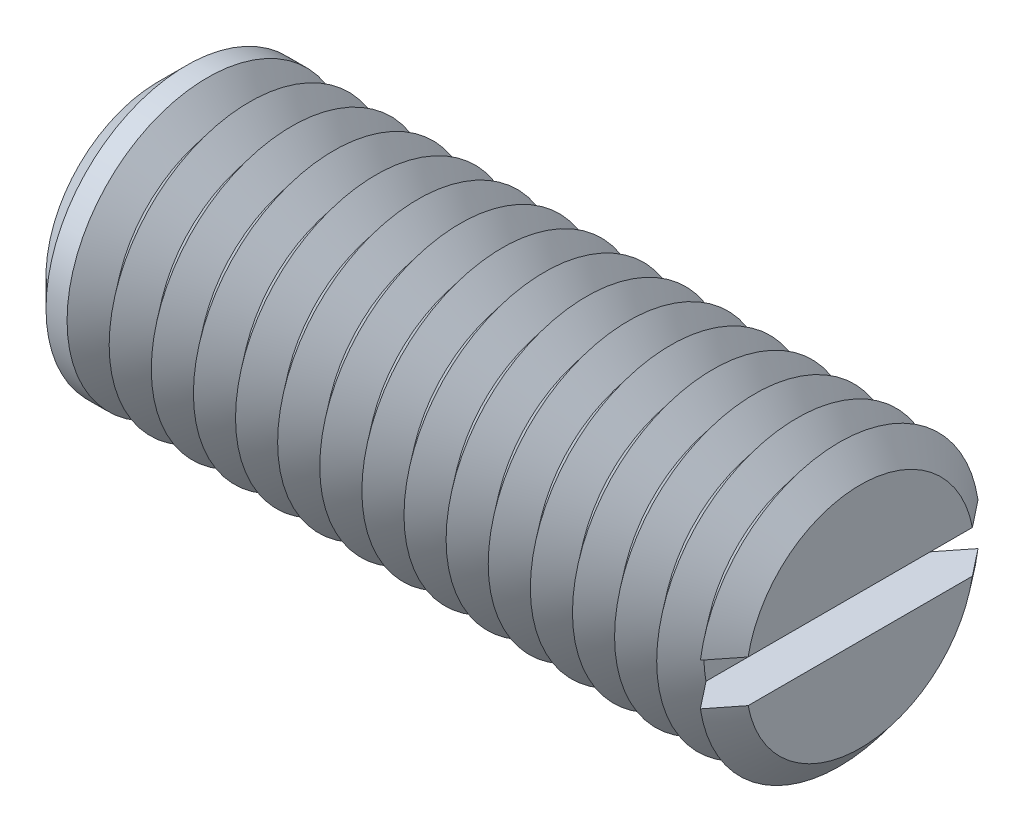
ISO-10303-21;
HEADER;
FILE_DESCRIPTION(('STEP AP214'),'2;1');
FILE_NAME('part.step','',(''),(''),'','','');
FILE_SCHEMA(('AUTOMOTIVE_DESIGN { 1 0 10303 214 1 1 1 1 }'));
ENDSEC;
DATA;
#1=APPLICATION_CONTEXT('core data for automotive mechanical design processes');
#2=APPLICATION_PROTOCOL_DEFINITION('international standard','automotive_design',2000,#1);
#3=PRODUCT_CONTEXT('',#1,'mechanical');
#4=PRODUCT('Part','Part','',(#3));
#5=PRODUCT_RELATED_PRODUCT_CATEGORY('part','',(#4));
#6=PRODUCT_DEFINITION_FORMATION('','',#4);
#7=PRODUCT_DEFINITION_CONTEXT('part definition',#1,'design');
#8=PRODUCT_DEFINITION('design','',#6,#7);
#9=PRODUCT_DEFINITION_SHAPE('','',#8);
#10=(LENGTH_UNIT() NAMED_UNIT(*) SI_UNIT(.MILLI.,.METRE.));
#11=(NAMED_UNIT(*) PLANE_ANGLE_UNIT() SI_UNIT($,.RADIAN.));
#12=(NAMED_UNIT(*) SI_UNIT($,.STERADIAN.) SOLID_ANGLE_UNIT());
#13=UNCERTAINTY_MEASURE_WITH_UNIT(LENGTH_MEASURE(1.E-05),#10,'distance_accuracy_value','');
#14=(GEOMETRIC_REPRESENTATION_CONTEXT(3) GLOBAL_UNCERTAINTY_ASSIGNED_CONTEXT((#13)) GLOBAL_UNIT_ASSIGNED_CONTEXT((#10,
#11,#12)) REPRESENTATION_CONTEXT('',''));
#15=CARTESIAN_POINT('',(0.,0.,0.));
#16=DIRECTION('',(0.,0.,1.));
#17=DIRECTION('',(1.,0.,0.));
#18=AXIS2_PLACEMENT_3D('',#15,#16,#17);
#19=CARTESIAN_POINT('',(11.75,0.,0.));
#20=DIRECTION('',(1.,0.,0.));
#21=DIRECTION('',(0.,0.,-1.));
#22=AXIS2_PLACEMENT_3D('',#19,#20,#21);
#23=CONICAL_SURFACE('',#22,5.,0.895664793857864);
#24=CARTESIAN_POINT('',(11.75,0.,0.));
#25=DIRECTION('',(-1.,0.,0.));
#26=DIRECTION('',(0.,0.,1.));
#27=AXIS2_PLACEMENT_3D('',#24,#25,#26);
#28=CIRCLE('',#27,5.);
#29=CARTESIAN_POINT('',(11.75,-0.75,-4.9434299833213));
#30=VERTEX_POINT('',#29);
#31=CARTESIAN_POINT('',(11.75,-0.75,4.9434299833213));
#32=VERTEX_POINT('',#31);
#33=EDGE_CURVE('E117',#30,#32,#28,.T.);
#34=ORIENTED_EDGE('',*,*,#33,.T.);
#35=CARTESIAN_POINT('',(16.4886555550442,-0.75,-10.8927895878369));
#36=CARTESIAN_POINT('',(16.178663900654,-0.75,-10.5046848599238));
#37=CARTESIAN_POINT('',(15.8687121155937,-0.75,-10.1165482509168));
#38=CARTESIAN_POINT('',(15.2489116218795,-0.75,-9.34012563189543));
#39=CARTESIAN_POINT('',(14.9390629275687,-0.75,-8.95183961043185));
#40=CARTESIAN_POINT('',(14.3189382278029,-0.75,-8.1743381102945));
#41=CARTESIAN_POINT('',(14.0086626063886,-0.75,-7.78512232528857));
#42=CARTESIAN_POINT('',(13.3884400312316,-0.75,-7.00649525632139));
#43=CARTESIAN_POINT('',(13.0784930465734,-0.75,-6.61708399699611));
#44=CARTESIAN_POINT('',(12.6053943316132,-0.75,-6.02191131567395));
#45=CARTESIAN_POINT('',(12.4420627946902,-0.75,-5.81629283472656));
#46=CARTESIAN_POINT('',(12.1155893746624,-0.75,-5.40490151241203));
#47=CARTESIAN_POINT('',(11.9524474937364,-0.75,-5.19912866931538));
#48=CARTESIAN_POINT('',(11.6263799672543,-0.75,-4.78730226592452));
#49=CARTESIAN_POINT('',(11.4634544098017,-0.75,-4.58124863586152));
#50=CARTESIAN_POINT('',(11.138006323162,-0.75,-4.16883695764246));
#51=CARTESIAN_POINT('',(10.9754837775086,-0.75,-3.96247892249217));
#52=CARTESIAN_POINT('',(10.6512888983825,-0.75,-3.54956515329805));
#53=CARTESIAN_POINT('',(10.4896156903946,-0.75,-3.34301010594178));
#54=CARTESIAN_POINT('',(10.1672688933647,-0.75,-2.92906737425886));
#55=CARTESIAN_POINT('',(10.0065954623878,-0.75,-2.72167956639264));
#56=CARTESIAN_POINT('',(9.76711629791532,-0.75,-2.40952296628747));
#57=CARTESIAN_POINT('',(9.68756906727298,-0.75,-2.30532351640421));
#58=CARTESIAN_POINT('',(9.52920893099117,-0.75,-2.09636868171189));
#59=CARTESIAN_POINT('',(9.45039601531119,-0.75,-1.99161330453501));
#60=CARTESIAN_POINT('',(9.2939159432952,-0.75,-1.78128982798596));
#61=CARTESIAN_POINT('',(9.21624850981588,-0.75,-1.67572193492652));
#62=CARTESIAN_POINT('',(9.06274835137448,-0.75,-1.46326300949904));
#63=CARTESIAN_POINT('',(8.98691541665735,-0.75,-1.35637213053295));
#64=CARTESIAN_POINT('',(8.89612915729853,-0.75,-1.22407390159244));
#65=CARTESIAN_POINT('',(8.87957407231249,-0.75,-1.19976686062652));
#66=CARTESIAN_POINT('',(8.84666824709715,-0.75,-1.15101442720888));
#67=CARTESIAN_POINT('',(8.8303175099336,-0.75,-1.12656903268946));
#68=CARTESIAN_POINT('',(8.78161616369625,-0.75,-1.05299302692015));
#69=CARTESIAN_POINT('',(8.74961925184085,-0.75,-1.00362669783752));
#70=CARTESIAN_POINT('',(8.68688907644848,-0.75,-0.903957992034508));
#71=CARTESIAN_POINT('',(8.6561584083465,-0.75,-0.853653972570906));
#72=CARTESIAN_POINT('',(8.59663090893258,-0.75,-0.751913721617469));
#73=CARTESIAN_POINT('',(8.56783371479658,-0.75,-0.700477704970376));
#74=CARTESIAN_POINT('',(8.5225435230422,-0.75,-0.613963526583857));
#75=CARTESIAN_POINT('',(8.50521866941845,-0.75,-0.579327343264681));
#76=CARTESIAN_POINT('',(8.47226872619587,-0.75,-0.509265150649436));
#77=CARTESIAN_POINT('',(8.45664397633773,-0.75,-0.473838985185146));
#78=CARTESIAN_POINT('',(8.41326593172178,-0.75,-0.366382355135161));
#79=CARTESIAN_POINT('',(8.3888237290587,-0.75,-0.292842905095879));
#80=CARTESIAN_POINT('',(8.36584056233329,-0.75,-0.189809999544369));
#81=CARTESIAN_POINT('',(8.36068569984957,-0.75,-0.161782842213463));
#82=CARTESIAN_POINT('',(8.35277045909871,-0.75,-0.105398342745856));
#83=CARTESIAN_POINT('',(8.35000880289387,-0.75,-0.0770411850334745));
#84=CARTESIAN_POINT('',(8.34706843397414,-0.75,-0.0202548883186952));
#85=CARTESIAN_POINT('',(8.34688391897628,-0.75,0.00817394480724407));
#86=CARTESIAN_POINT('',(8.34909504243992,-0.75,0.0649322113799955));
#87=CARTESIAN_POINT('',(8.35149108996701,-0.75,0.0932616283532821));
#88=CARTESIAN_POINT('',(8.35969372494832,-0.75,0.157351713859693));
#89=CARTESIAN_POINT('',(8.36625653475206,-0.75,0.193015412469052));
#90=CARTESIAN_POINT('',(8.38270209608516,-0.75,0.263573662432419));
#91=CARTESIAN_POINT('',(8.39258747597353,-0.75,0.298467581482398));
#92=CARTESIAN_POINT('',(8.41505982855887,-0.75,0.367652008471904));
#93=CARTESIAN_POINT('',(8.42766677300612,-0.75,0.40193591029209));
#94=CARTESIAN_POINT('',(8.45491306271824,-0.75,0.469664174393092));
#95=CARTESIAN_POINT('',(8.46955194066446,-0.75,0.503108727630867));
#96=CARTESIAN_POINT('',(8.51663503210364,-0.75,0.604259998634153));
#97=CARTESIAN_POINT('',(8.55154239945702,-0.75,0.67081090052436));
#98=CARTESIAN_POINT('',(8.62505888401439,-0.75,0.801849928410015));
#99=CARTESIAN_POINT('',(8.6636717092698,-0.75,0.866335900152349));
#100=CARTESIAN_POINT('',(8.74327398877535,-0.75,0.994050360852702));
#101=CARTESIAN_POINT('',(8.78426939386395,-0.75,1.05727512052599));
#102=CARTESIAN_POINT('',(8.86774032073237,-0.75,1.18274150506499));
#103=CARTESIAN_POINT('',(8.91021601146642,-0.75,1.24498301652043));
#104=CARTESIAN_POINT('',(8.99630669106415,-0.75,1.36895722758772));
#105=CARTESIAN_POINT('',(9.03992480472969,-0.75,1.43068775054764));
#106=CARTESIAN_POINT('',(9.12788194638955,-0.75,1.55364126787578));
#107=CARTESIAN_POINT('',(9.17222104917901,-0.75,1.61486420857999));
#108=CARTESIAN_POINT('',(9.26134084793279,-0.75,1.73681254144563));
#109=CARTESIAN_POINT('',(9.30612056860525,-0.75,1.79753864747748));
#110=CARTESIAN_POINT('',(9.39607323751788,-0.75,1.91869503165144));
#111=CARTESIAN_POINT('',(9.44124617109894,-0.75,1.9791253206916));
#112=CARTESIAN_POINT('',(9.57610920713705,-0.75,2.15860363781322));
#113=CARTESIAN_POINT('',(9.66623597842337,-0.75,2.27732336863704));
#114=CARTESIAN_POINT('',(9.84723159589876,-0.75,2.51419617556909));
#115=CARTESIAN_POINT('',(9.93810045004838,-0.75,2.63234924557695));
#116=CARTESIAN_POINT('',(10.2114512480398,-0.75,2.98624879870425));
#117=CARTESIAN_POINT('',(10.3946699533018,-0.75,3.22142577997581));
#118=CARTESIAN_POINT('',(10.762238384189,-0.75,3.69117947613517));
#119=CARTESIAN_POINT('',(10.9465888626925,-0.75,3.92575559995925));
#120=CARTESIAN_POINT('',(11.31587911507,-0.75,4.39443534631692));
#121=CARTESIAN_POINT('',(11.500818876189,-0.75,4.62853897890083));
#122=CARTESIAN_POINT('',(11.870331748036,-0.75,5.09551589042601));
#123=CARTESIAN_POINT('',(12.0549033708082,-0.75,5.3283903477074));
#124=CARTESIAN_POINT('',(12.4242990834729,-0.75,5.79394105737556));
#125=CARTESIAN_POINT('',(12.6091231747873,-0.75,6.0266173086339));
#126=CARTESIAN_POINT('',(13.1637745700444,-0.75,6.72433690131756));
#127=CARTESIAN_POINT('',(13.5338620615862,-0.75,7.18917337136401));
#128=CARTESIAN_POINT('',(14.1190458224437,-0.75,7.92356230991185));
#129=CARTESIAN_POINT('',(14.3340169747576,-0.75,8.19321453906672));
#130=CARTESIAN_POINT('',(14.7640698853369,-0.75,8.73245662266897));
#131=CARTESIAN_POINT('',(14.979151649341,-0.75,9.00204647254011));
#132=CARTESIAN_POINT('',(15.4099436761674,-0.75,9.54186292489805));
#133=CARTESIAN_POINT('',(15.6256541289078,-0.75,9.8120893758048));
#134=CARTESIAN_POINT('',(16.0571210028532,-0.75,10.3524795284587));
#135=CARTESIAN_POINT('',(16.2728774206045,-0.75,10.6226432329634));
#136=CARTESIAN_POINT('',(16.4886555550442,-0.75,10.8927895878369));
#137=B_SPLINE_CURVE_WITH_KNOTS('',3,(#35,#36,#37,#38,#39,#40,#41,#42,#43,#44,#45,#46,#47,#48,
#49,#50,#51,#52,#53,#54,#55,#56,#57,#58,#59,#60,#61,#62,#63,#64,#65,#66,#67,#68,#69,#70,#71,#72,
#73,#74,#75,#76,#77,#78,#79,#80,#81,#82,#83,#84,#85,#86,#87,#88,#89,#90,#91,#92,#93,#94,#95,#96,
#97,#98,#99,#100,#101,#102,#103,#104,#105,#106,#107,#108,#109,#110,#111,#112,#113,#114,#115,
#116,#117,#118,#119,#120,#121,#122,#123,#124,#125,#126,#127,#128,#129,#130,#131,#132,#133,#134,
#135,#136),.UNSPECIFIED.,.F.,.F.,(4,2,2,2,2,2,2,2,2,2,2,2,2,2,2,2,2,2,2,2,2,2,2,2,2,2,2,2,2,2,2,
2,2,2,2,2,2,2,2,2,2,2,2,2,2,2,2,2,2,2,4),(0.,1.49012787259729,2.98041311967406,4.47367759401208,
5.96678625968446,6.75457128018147,7.54236526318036,8.33041673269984,9.11843545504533,
9.90534542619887,10.6923767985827,11.0856530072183,11.4789238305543,11.8720978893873,
12.265226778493,12.3534535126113,12.441681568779,12.6181526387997,12.7949690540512,
12.9717521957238,13.0878863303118,13.2040436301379,13.43522465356,13.5206311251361,
13.6059919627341,13.6911605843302,13.7763427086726,13.8849305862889,13.9936045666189,
14.1031049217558,14.2125801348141,14.4377857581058,14.6632191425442,14.8892420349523,
15.1152908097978,15.3420406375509,15.5688141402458,15.7951656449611,16.0215087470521,
16.4686664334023,16.91582892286,17.8101909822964,18.7052318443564,19.6002534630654,
20.4916985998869,21.3831487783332,23.1656575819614,24.2002223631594,25.2348477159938,
26.2721422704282,27.3093757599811),.UNSPECIFIED.);
#138=CARTESIAN_POINT('',(11.,-0.75,3.99343248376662));
#139=VERTEX_POINT('',#138);
#140=EDGE_CURVE('E109',#139,#32,#137,.T.);
#141=ORIENTED_EDGE('',*,*,#140,.F.);
#142=CARTESIAN_POINT('',(11.,0.,0.));
#143=DIRECTION('',(-1.,0.,0.));
#144=DIRECTION('',(0.,0.,1.));
#145=AXIS2_PLACEMENT_3D('',#142,#143,#144);
#146=CIRCLE('',#145,4.06325030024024);
#147=CARTESIAN_POINT('',(11.,-0.75,-3.99343248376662));
#148=VERTEX_POINT('',#147);
#149=EDGE_CURVE('E344',#148,#139,#146,.T.);
#150=ORIENTED_EDGE('',*,*,#149,.F.);
#151=EDGE_CURVE('E58',#30,#148,#137,.T.);
#152=ORIENTED_EDGE('',*,*,#151,.F.);
#153=EDGE_LOOP('',(#34,#141,#150,#152));
#154=FACE_BOUND('',#153,.T.);
#155=ADVANCED_FACE('F37',(#154),#23,.T.);
#156=CARTESIAN_POINT('',(11.75,0.75,4.9434299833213));
#157=VERTEX_POINT('',#156);
#158=CARTESIAN_POINT('',(11.75,0.75,-4.9434299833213));
#159=VERTEX_POINT('',#158);
#160=EDGE_CURVE('E100',#157,#159,#28,.T.);
#161=ORIENTED_EDGE('',*,*,#160,.T.);
#162=CARTESIAN_POINT('',(16.4886555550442,0.75,10.8927895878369));
#163=CARTESIAN_POINT('',(16.178663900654,0.75,10.5046848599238));
#164=CARTESIAN_POINT('',(15.8687121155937,0.75,10.1165482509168));
#165=CARTESIAN_POINT('',(15.2489116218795,0.75,9.34012563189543));
#166=CARTESIAN_POINT('',(14.9390629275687,0.75,8.95183961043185));
#167=CARTESIAN_POINT('',(14.3189382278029,0.75,8.17433811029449));
#168=CARTESIAN_POINT('',(14.0086626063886,0.75,7.78512232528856));
#169=CARTESIAN_POINT('',(13.3884400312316,0.75,7.00649525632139));
#170=CARTESIAN_POINT('',(13.0784930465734,0.75,6.6170839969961));
#171=CARTESIAN_POINT('',(12.6053943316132,0.75,6.02191131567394));
#172=CARTESIAN_POINT('',(12.4420627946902,0.75,5.81629283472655));
#173=CARTESIAN_POINT('',(12.1155893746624,0.75,5.40490151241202));
#174=CARTESIAN_POINT('',(11.9524474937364,0.75,5.19912866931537));
#175=CARTESIAN_POINT('',(11.6263799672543,0.75,4.78730226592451));
#176=CARTESIAN_POINT('',(11.4634544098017,0.75,4.58124863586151));
#177=CARTESIAN_POINT('',(11.138006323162,0.75,4.16883695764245));
#178=CARTESIAN_POINT('',(10.9754837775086,0.75,3.96247892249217));
#179=CARTESIAN_POINT('',(10.6512888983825,0.75,3.54956515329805));
#180=CARTESIAN_POINT('',(10.4896156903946,0.75,3.34301010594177));
#181=CARTESIAN_POINT('',(10.1672688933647,0.75,2.92906737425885));
#182=CARTESIAN_POINT('',(10.0065954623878,0.75,2.72167956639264));
#183=CARTESIAN_POINT('',(9.76711629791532,0.75,2.40952296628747));
#184=CARTESIAN_POINT('',(9.68756906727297,0.75,2.30532351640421));
#185=CARTESIAN_POINT('',(9.52920893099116,0.75,2.09636868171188));
#186=CARTESIAN_POINT('',(9.45039601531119,0.75,1.99161330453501));
#187=CARTESIAN_POINT('',(9.2939159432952,0.75,1.78128982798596));
#188=CARTESIAN_POINT('',(9.21624850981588,0.75,1.67572193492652));
#189=CARTESIAN_POINT('',(9.06274835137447,0.75,1.46326300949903));
#190=CARTESIAN_POINT('',(8.98691541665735,0.75,1.35637213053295));
#191=CARTESIAN_POINT('',(8.89612915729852,0.75,1.22407390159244));
#192=CARTESIAN_POINT('',(8.87957407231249,0.75,1.19976686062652));
#193=CARTESIAN_POINT('',(8.84666824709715,0.75,1.15101442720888));
#194=CARTESIAN_POINT('',(8.8303175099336,0.75,1.12656903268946));
#195=CARTESIAN_POINT('',(8.78161616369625,0.75,1.05299302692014));
#196=CARTESIAN_POINT('',(8.74961925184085,0.75,1.00362669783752));
#197=CARTESIAN_POINT('',(8.68688907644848,0.75,0.903957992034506));
#198=CARTESIAN_POINT('',(8.6561584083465,0.75,0.853653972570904));
#199=CARTESIAN_POINT('',(8.59663090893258,0.75,0.751913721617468));
#200=CARTESIAN_POINT('',(8.56783371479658,0.75,0.700477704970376));
#201=CARTESIAN_POINT('',(8.5225435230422,0.75,0.613963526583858));
#202=CARTESIAN_POINT('',(8.50521866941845,0.75,0.579327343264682));
#203=CARTESIAN_POINT('',(8.47226872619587,0.75,0.509265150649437));
#204=CARTESIAN_POINT('',(8.45664397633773,0.75,0.473838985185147));
#205=CARTESIAN_POINT('',(8.41326593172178,0.75,0.366382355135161));
#206=CARTESIAN_POINT('',(8.3888237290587,0.75,0.292842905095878));
#207=CARTESIAN_POINT('',(8.36584056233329,0.75,0.189809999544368));
#208=CARTESIAN_POINT('',(8.36068569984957,0.75,0.161782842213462));
#209=CARTESIAN_POINT('',(8.35277045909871,0.75,0.105398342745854));
#210=CARTESIAN_POINT('',(8.35000880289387,0.75,0.077041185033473));
#211=CARTESIAN_POINT('',(8.34706843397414,0.75,0.0202548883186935));
#212=CARTESIAN_POINT('',(8.34688391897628,0.75,-0.00817394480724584));
#213=CARTESIAN_POINT('',(8.34909504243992,0.75,-0.0649322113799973));
#214=CARTESIAN_POINT('',(8.35149108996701,0.75,-0.0932616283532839));
#215=CARTESIAN_POINT('',(8.35969372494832,0.75,-0.157351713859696));
#216=CARTESIAN_POINT('',(8.36625653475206,0.75,-0.193015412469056));
#217=CARTESIAN_POINT('',(8.38270209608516,0.75,-0.263573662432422));
#218=CARTESIAN_POINT('',(8.39258747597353,0.75,-0.298467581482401));
#219=CARTESIAN_POINT('',(8.41505982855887,0.75,-0.367652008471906));
#220=CARTESIAN_POINT('',(8.42766677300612,0.75,-0.401935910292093));
#221=CARTESIAN_POINT('',(8.45491306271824,0.75,-0.469664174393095));
#222=CARTESIAN_POINT('',(8.46955194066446,0.75,-0.50310872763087));
#223=CARTESIAN_POINT('',(8.51663503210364,0.75,-0.604259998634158));
#224=CARTESIAN_POINT('',(8.55154239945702,0.75,-0.670810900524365));
#225=CARTESIAN_POINT('',(8.62505888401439,0.75,-0.801849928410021));
#226=CARTESIAN_POINT('',(8.6636717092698,0.75,-0.866335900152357));
#227=CARTESIAN_POINT('',(8.74327398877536,0.75,-0.994050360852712));
#228=CARTESIAN_POINT('',(8.78426939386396,0.75,-1.057275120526));
#229=CARTESIAN_POINT('',(8.86774032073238,0.75,-1.182741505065));
#230=CARTESIAN_POINT('',(8.91021601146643,0.75,-1.24498301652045));
#231=CARTESIAN_POINT('',(8.99630669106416,0.75,-1.36895722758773));
#232=CARTESIAN_POINT('',(9.0399248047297,0.75,-1.43068775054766));
#233=CARTESIAN_POINT('',(9.12788194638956,0.75,-1.55364126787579));
#234=CARTESIAN_POINT('',(9.17222104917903,0.75,-1.61486420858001));
#235=CARTESIAN_POINT('',(9.26134084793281,0.75,-1.73681254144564));
#236=CARTESIAN_POINT('',(9.30612056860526,0.75,-1.7975386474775));
#237=CARTESIAN_POINT('',(9.39607323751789,0.75,-1.91869503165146));
#238=CARTESIAN_POINT('',(9.44124617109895,0.75,-1.97912532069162));
#239=CARTESIAN_POINT('',(9.57610920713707,0.75,-2.15860363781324));
#240=CARTESIAN_POINT('',(9.66623597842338,0.75,-2.27732336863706));
#241=CARTESIAN_POINT('',(9.84723159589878,0.75,-2.51419617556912));
#242=CARTESIAN_POINT('',(9.9381004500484,0.75,-2.63234924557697));
#243=CARTESIAN_POINT('',(10.2114512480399,0.75,-2.98624879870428));
#244=CARTESIAN_POINT('',(10.3946699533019,0.75,-3.22142577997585));
#245=CARTESIAN_POINT('',(10.762238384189,0.75,-3.69117947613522));
#246=CARTESIAN_POINT('',(10.9465888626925,0.75,-3.92575559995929));
#247=CARTESIAN_POINT('',(11.3158791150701,0.75,-4.39443534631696));
#248=CARTESIAN_POINT('',(11.5008188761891,0.75,-4.62853897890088));
#249=CARTESIAN_POINT('',(11.870331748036,0.75,-5.09551589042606));
#250=CARTESIAN_POINT('',(12.0549033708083,0.75,-5.32839034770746));
#251=CARTESIAN_POINT('',(12.424299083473,0.75,-5.79394105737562));
#252=CARTESIAN_POINT('',(12.6091231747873,0.75,-6.02661730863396));
#253=CARTESIAN_POINT('',(13.1637745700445,0.75,-6.72433690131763));
#254=CARTESIAN_POINT('',(13.5338620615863,0.75,-7.18917337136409));
#255=CARTESIAN_POINT('',(14.1190458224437,0.75,-7.92356230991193));
#256=CARTESIAN_POINT('',(14.3340169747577,0.75,-8.19321453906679));
#257=CARTESIAN_POINT('',(14.7640698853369,0.75,-8.73245662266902));
#258=CARTESIAN_POINT('',(14.979151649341,0.75,-9.00204647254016));
#259=CARTESIAN_POINT('',(15.4099436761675,0.75,-9.54186292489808));
#260=CARTESIAN_POINT('',(15.6256541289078,0.75,-9.81208937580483));
#261=CARTESIAN_POINT('',(16.0571210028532,0.75,-10.3524795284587));
#262=CARTESIAN_POINT('',(16.2728774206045,0.75,-10.6226432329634));
#263=CARTESIAN_POINT('',(16.4886555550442,0.75,-10.8927895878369));
#264=B_SPLINE_CURVE_WITH_KNOTS('',3,(#162,#163,#164,#165,#166,#167,#168,#169,#170,#171,#172,
#173,#174,#175,#176,#177,#178,#179,#180,#181,#182,#183,#184,#185,#186,#187,#188,#189,#190,#191,
#192,#193,#194,#195,#196,#197,#198,#199,#200,#201,#202,#203,#204,#205,#206,#207,#208,#209,#210,
#211,#212,#213,#214,#215,#216,#217,#218,#219,#220,#221,#222,#223,#224,#225,#226,#227,#228,#229,
#230,#231,#232,#233,#234,#235,#236,#237,#238,#239,#240,#241,#242,#243,#244,#245,#246,#247,#248,
#249,#250,#251,#252,#253,#254,#255,#256,#257,#258,#259,#260,#261,#262,#263),.UNSPECIFIED.,.F.,
.F.,(4,2,2,2,2,2,2,2,2,2,2,2,2,2,2,2,2,2,2,2,2,2,2,2,2,2,2,2,2,2,2,2,2,2,2,2,2,2,2,2,2,2,2,2,2,
2,2,2,2,2,4),(0.,1.49012787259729,2.98041311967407,4.47367759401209,5.96678625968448,
6.75457128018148,7.54236526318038,8.33041673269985,9.11843545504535,9.90534542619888,
10.6923767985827,11.0856530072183,11.4789238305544,11.8720978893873,12.265226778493,
12.3534535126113,12.441681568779,12.6181526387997,12.7949690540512,12.9717521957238,
13.0878863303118,13.2040436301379,13.43522465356,13.5206311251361,13.6059919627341,
13.6911605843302,13.7763427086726,13.8849305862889,13.9936045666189,14.1031049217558,
14.2125801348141,14.4377857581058,14.6632191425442,14.8892420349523,15.1152908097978,
15.3420406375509,15.5688141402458,15.7951656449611,16.0215087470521,16.4686664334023,
16.91582892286,17.8101909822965,18.7052318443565,19.6002534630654,20.491698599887,
21.3831487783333,23.1656575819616,24.2002223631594,25.2348477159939,26.2721422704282,
27.3093757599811),.UNSPECIFIED.);
#265=CARTESIAN_POINT('',(11.,0.75,-3.99343248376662));
#266=VERTEX_POINT('',#265);
#267=EDGE_CURVE('E110',#266,#159,#264,.T.);
#268=ORIENTED_EDGE('',*,*,#267,.F.);
#269=CARTESIAN_POINT('',(11.,0.75,3.99343248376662));
#270=VERTEX_POINT('',#269);
#271=EDGE_CURVE('E103',#270,#266,#146,.T.);
#272=ORIENTED_EDGE('',*,*,#271,.F.);
#273=EDGE_CURVE('E97',#157,#270,#264,.T.);
#274=ORIENTED_EDGE('',*,*,#273,.F.);
#275=EDGE_LOOP('',(#161,#268,#272,#274));
#276=FACE_BOUND('',#275,.T.);
#277=ADVANCED_FACE('F99',(#276),#23,.T.);
#278=CARTESIAN_POINT('',(11.,0.,0.));
#279=DIRECTION('',(-1.,0.,0.));
#280=DIRECTION('',(0.,0.,1.));
#281=AXIS2_PLACEMENT_3D('',#278,#279,#280);
#282=CONICAL_SURFACE('',#281,4.06325030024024,0.895664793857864);
#283=CARTESIAN_POINT('',(10.25,0.,0.));
#284=DIRECTION('',(-1.,0.,0.));
#285=DIRECTION('',(0.,0.,1.));
#286=AXIS2_PLACEMENT_3D('',#283,#284,#285);
#287=CIRCLE('',#286,5.);
#288=CARTESIAN_POINT('',(10.25,0.,5.));
#289=VERTEX_POINT('',#288);
#290=EDGE_CURVE('E330',#289,#289,#287,.T.);
#291=ORIENTED_EDGE('',*,*,#290,.F.);
#292=EDGE_LOOP('',(#291));
#293=FACE_BOUND('',#292,.T.);
#294=ORIENTED_EDGE('',*,*,#271,.T.);
#295=EDGE_CURVE('E338',#266,#148,#146,.T.);
#296=ORIENTED_EDGE('',*,*,#295,.T.);
#297=ORIENTED_EDGE('',*,*,#149,.T.);
#298=EDGE_CURVE('E336',#139,#270,#146,.T.);
#299=ORIENTED_EDGE('',*,*,#298,.T.);
#300=EDGE_LOOP('',(#294,#296,#297,#299));
#301=FACE_BOUND('',#300,.T.);
#302=ADVANCED_FACE('F167',(#293,#301),#282,.T.);
#303=CARTESIAN_POINT('',(12.5,0.,0.));
#304=DIRECTION('',(1.,0.,0.));
#305=DIRECTION('',(0.,0.,-1.));
#306=AXIS2_PLACEMENT_3D('',#303,#304,#305);
#307=PLANE('',#306);
#308=CARTESIAN_POINT('',(12.5,0.,0.));
#309=DIRECTION('',(-1.,0.,0.));
#310=DIRECTION('',(0.,0.,1.));
#311=AXIS2_PLACEMENT_3D('',#308,#309,#310);
#312=CIRCLE('',#311,4.06325030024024);
#313=CARTESIAN_POINT('',(12.5,0.75,3.99343248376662));
#314=VERTEX_POINT('',#313);
#315=CARTESIAN_POINT('',(12.5,0.75,-3.99343248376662));
#316=VERTEX_POINT('',#315);
#317=EDGE_CURVE('E159',#314,#316,#312,.T.);
#318=ORIENTED_EDGE('',*,*,#317,.F.);
#319=DIRECTION('',(0.,0.,1.));
#320=VECTOR('',#319,1.);
#321=CARTESIAN_POINT('',(12.5,0.75,0.));
#322=LINE('',#321,#320);
#323=EDGE_CURVE('E122',#316,#314,#322,.T.);
#324=ORIENTED_EDGE('',*,*,#323,.F.);
#325=EDGE_LOOP('',(#318,#324));
#326=FACE_BOUND('',#325,.T.);
#327=ADVANCED_FACE('F171',(#326),#307,.T.);
#328=CARTESIAN_POINT('',(12.5,-0.75,-3.99343248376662));
#329=VERTEX_POINT('',#328);
#330=CARTESIAN_POINT('',(12.5,-0.75,3.99343248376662));
#331=VERTEX_POINT('',#330);
#332=EDGE_CURVE('E66',#329,#331,#312,.T.);
#333=ORIENTED_EDGE('',*,*,#332,.F.);
#334=DIRECTION('',(0.,0.,-1.));
#335=VECTOR('',#334,1.);
#336=CARTESIAN_POINT('',(12.5,-0.75,0.));
#337=LINE('',#336,#335);
#338=EDGE_CURVE('E135',#331,#329,#337,.T.);
#339=ORIENTED_EDGE('',*,*,#338,.F.);
#340=EDGE_LOOP('',(#333,#339));
#341=FACE_BOUND('',#340,.T.);
#342=ADVANCED_FACE('F198',(#341),#307,.T.);
#343=CARTESIAN_POINT('',(12.5,0.,0.));
#344=DIRECTION('',(-1.,0.,0.));
#345=DIRECTION('',(0.,0.,1.));
#346=AXIS2_PLACEMENT_3D('',#343,#344,#345);
#347=CONICAL_SURFACE('',#346,4.06325030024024,0.895664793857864);
#348=ORIENTED_EDGE('',*,*,#160,.F.);
#349=CARTESIAN_POINT('',(7.01134444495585,0.75,-10.8927895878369));
#350=CARTESIAN_POINT('',(7.32133609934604,0.75,-10.5046848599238));
#351=CARTESIAN_POINT('',(7.63128788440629,0.75,-10.1165482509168));
#352=CARTESIAN_POINT('',(8.2510883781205,0.75,-9.34012563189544));
#353=CARTESIAN_POINT('',(8.56093707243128,0.75,-8.95183961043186));
#354=CARTESIAN_POINT('',(9.1810617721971,0.75,-8.17433811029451));
#355=CARTESIAN_POINT('',(9.49133739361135,0.75,-7.78512232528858));
#356=CARTESIAN_POINT('',(10.1115599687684,0.75,-7.0064952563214));
#357=CARTESIAN_POINT('',(10.4215069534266,0.75,-6.61708399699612));
#358=CARTESIAN_POINT('',(10.8946056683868,0.75,-6.02191131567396));
#359=CARTESIAN_POINT('',(11.0579372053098,0.75,-5.81629283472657));
#360=CARTESIAN_POINT('',(11.3844106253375,0.75,-5.40490151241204));
#361=CARTESIAN_POINT('',(11.5475525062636,0.75,-5.19912866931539));
#362=CARTESIAN_POINT('',(11.8736200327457,0.75,-4.78730226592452));
#363=CARTESIAN_POINT('',(12.0365455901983,0.75,-4.58124863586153));
#364=CARTESIAN_POINT('',(12.361993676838,0.75,-4.16883695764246));
#365=CARTESIAN_POINT('',(12.5245162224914,0.75,-3.96247892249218));
#366=CARTESIAN_POINT('',(12.8487111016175,0.75,-3.54956515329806));
#367=CARTESIAN_POINT('',(13.0103843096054,0.75,-3.34301010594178));
#368=CARTESIAN_POINT('',(13.3327311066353,0.75,-2.92906737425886));
#369=CARTESIAN_POINT('',(13.4934045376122,0.75,-2.72167956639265));
#370=CARTESIAN_POINT('',(13.7328837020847,0.75,-2.40952296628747));
#371=CARTESIAN_POINT('',(13.812430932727,0.75,-2.30532351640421));
#372=CARTESIAN_POINT('',(13.9707910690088,0.75,-2.09636868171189));
#373=CARTESIAN_POINT('',(14.0496039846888,0.75,-1.99161330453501));
#374=CARTESIAN_POINT('',(14.2060840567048,0.75,-1.78128982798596));
#375=CARTESIAN_POINT('',(14.2837514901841,0.75,-1.67572193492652));
#376=CARTESIAN_POINT('',(14.4372516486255,0.75,-1.46326300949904));
#377=CARTESIAN_POINT('',(14.5130845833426,0.75,-1.35637213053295));
#378=CARTESIAN_POINT('',(14.6038708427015,0.75,-1.22407390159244));
#379=CARTESIAN_POINT('',(14.6204259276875,0.75,-1.19976686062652));
#380=CARTESIAN_POINT('',(14.6533317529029,0.75,-1.15101442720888));
#381=CARTESIAN_POINT('',(14.6696824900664,0.75,-1.12656903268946));
#382=CARTESIAN_POINT('',(14.7183838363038,0.75,-1.05299302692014));
#383=CARTESIAN_POINT('',(14.7503807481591,0.75,-1.00362669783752));
#384=CARTESIAN_POINT('',(14.8131109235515,0.75,-0.903957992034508));
#385=CARTESIAN_POINT('',(14.8438415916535,0.75,-0.853653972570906));
#386=CARTESIAN_POINT('',(14.9033690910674,0.75,-0.751913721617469));
#387=CARTESIAN_POINT('',(14.9321662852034,0.75,-0.700477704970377));
#388=CARTESIAN_POINT('',(14.9774564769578,0.75,-0.613963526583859));
#389=CARTESIAN_POINT('',(14.9947813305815,0.75,-0.579327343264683));
#390=CARTESIAN_POINT('',(15.0277312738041,0.75,-0.509265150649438));
#391=CARTESIAN_POINT('',(15.0433560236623,0.75,-0.473838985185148));
#392=CARTESIAN_POINT('',(15.0867340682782,0.75,-0.366382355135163));
#393=CARTESIAN_POINT('',(15.1111762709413,0.75,-0.292842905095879));
#394=CARTESIAN_POINT('',(15.1341594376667,0.75,-0.189809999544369));
#395=CARTESIAN_POINT('',(15.1393143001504,0.75,-0.161782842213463));
#396=CARTESIAN_POINT('',(15.1472295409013,0.75,-0.105398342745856));
#397=CARTESIAN_POINT('',(15.1499911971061,0.75,-0.0770411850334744));
#398=CARTESIAN_POINT('',(15.1529315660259,0.75,-0.0202548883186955));
#399=CARTESIAN_POINT('',(15.1531160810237,0.75,0.00817394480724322));
#400=CARTESIAN_POINT('',(15.1509049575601,0.75,0.0649322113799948));
#401=CARTESIAN_POINT('',(15.148508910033,0.75,0.093261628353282));
#402=CARTESIAN_POINT('',(15.1403062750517,0.75,0.157351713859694));
#403=CARTESIAN_POINT('',(15.1337434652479,0.75,0.193015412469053));
#404=CARTESIAN_POINT('',(15.1172979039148,0.75,0.26357366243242));
#405=CARTESIAN_POINT('',(15.1074125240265,0.75,0.298467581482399));
#406=CARTESIAN_POINT('',(15.0849401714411,0.75,0.367652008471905));
#407=CARTESIAN_POINT('',(15.0723332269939,0.75,0.401935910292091));
#408=CARTESIAN_POINT('',(15.0450869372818,0.75,0.469664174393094));
#409=CARTESIAN_POINT('',(15.0304480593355,0.75,0.503108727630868));
#410=CARTESIAN_POINT('',(14.9833649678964,0.75,0.604259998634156));
#411=CARTESIAN_POINT('',(14.948457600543,0.75,0.670810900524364));
#412=CARTESIAN_POINT('',(14.8749411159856,0.75,0.80184992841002));
#413=CARTESIAN_POINT('',(14.8363282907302,0.75,0.866335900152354));
#414=CARTESIAN_POINT('',(14.7567260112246,0.75,0.994050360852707));
#415=CARTESIAN_POINT('',(14.715730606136,0.75,1.057275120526));
#416=CARTESIAN_POINT('',(14.6322596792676,0.75,1.18274150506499));
#417=CARTESIAN_POINT('',(14.5897839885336,0.75,1.24498301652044));
#418=CARTESIAN_POINT('',(14.5036933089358,0.75,1.36895722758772));
#419=CARTESIAN_POINT('',(14.4600751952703,0.75,1.43068775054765));
#420=CARTESIAN_POINT('',(14.3721180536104,0.75,1.55364126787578));
#421=CARTESIAN_POINT('',(14.327778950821,0.75,1.61486420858));
#422=CARTESIAN_POINT('',(14.2386591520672,0.75,1.73681254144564));
#423=CARTESIAN_POINT('',(14.1938794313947,0.75,1.79753864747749));
#424=CARTESIAN_POINT('',(14.1039267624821,0.75,1.91869503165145));
#425=CARTESIAN_POINT('',(14.0587538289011,0.75,1.9791253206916));
#426=CARTESIAN_POINT('',(13.9238907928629,0.75,2.15860363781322));
#427=CARTESIAN_POINT('',(13.8337640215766,0.75,2.27732336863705));
#428=CARTESIAN_POINT('',(13.6527684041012,0.75,2.5141961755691));
#429=CARTESIAN_POINT('',(13.5618995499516,0.75,2.63234924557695));
#430=CARTESIAN_POINT('',(13.2885487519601,0.75,2.98624879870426));
#431=CARTESIAN_POINT('',(13.1053300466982,0.75,3.22142577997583));
#432=CARTESIAN_POINT('',(12.737761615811,0.75,3.69117947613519));
#433=CARTESIAN_POINT('',(12.5534111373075,0.75,3.92575559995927));
#434=CARTESIAN_POINT('',(12.18412088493,0.75,4.39443534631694));
#435=CARTESIAN_POINT('',(11.999181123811,0.75,4.62853897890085));
#436=CARTESIAN_POINT('',(11.629668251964,0.75,5.09551589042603));
#437=CARTESIAN_POINT('',(11.4450966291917,0.75,5.32839034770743));
#438=CARTESIAN_POINT('',(11.0757009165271,0.75,5.79394105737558));
#439=CARTESIAN_POINT('',(10.8908768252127,0.75,6.02661730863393));
#440=CARTESIAN_POINT('',(10.3362254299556,0.75,6.72433690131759));
#441=CARTESIAN_POINT('',(9.96613793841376,0.75,7.18917337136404));
#442=CARTESIAN_POINT('',(9.3809541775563,0.75,7.92356230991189));
#443=CARTESIAN_POINT('',(9.16598302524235,0.75,8.19321453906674));
#444=CARTESIAN_POINT('',(8.73593011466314,0.75,8.73245662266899));
#445=CARTESIAN_POINT('',(8.52084835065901,0.75,9.00204647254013));
#446=CARTESIAN_POINT('',(8.09005632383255,0.75,9.54186292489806));
#447=CARTESIAN_POINT('',(7.87434587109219,0.75,9.81208937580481));
#448=CARTESIAN_POINT('',(7.44287899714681,0.75,10.3524795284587));
#449=CARTESIAN_POINT('',(7.22712257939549,0.75,10.6226432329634));
#450=CARTESIAN_POINT('',(7.01134444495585,0.75,10.8927895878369));
#451=B_SPLINE_CURVE_WITH_KNOTS('',3,(#349,#350,#351,#352,#353,#354,#355,#356,#357,#358,#359,
#360,#361,#362,#363,#364,#365,#366,#367,#368,#369,#370,#371,#372,#373,#374,#375,#376,#377,#378,
#379,#380,#381,#382,#383,#384,#385,#386,#387,#388,#389,#390,#391,#392,#393,#394,#395,#396,#397,
#398,#399,#400,#401,#402,#403,#404,#405,#406,#407,#408,#409,#410,#411,#412,#413,#414,#415,#416,
#417,#418,#419,#420,#421,#422,#423,#424,#425,#426,#427,#428,#429,#430,#431,#432,#433,#434,#435,
#436,#437,#438,#439,#440,#441,#442,#443,#444,#445,#446,#447,#448,#449,#450),.UNSPECIFIED.,.F.,
.F.,(4,2,2,2,2,2,2,2,2,2,2,2,2,2,2,2,2,2,2,2,2,2,2,2,2,2,2,2,2,2,2,2,2,2,2,2,2,2,2,2,2,2,2,2,2,
2,2,2,2,2,4),(0.,1.49012787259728,2.98041311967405,4.47367759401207,5.96678625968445,
6.75457128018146,7.54236526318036,8.33041673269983,9.11843545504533,9.90534542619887,
10.6923767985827,11.0856530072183,11.4789238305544,11.8720978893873,12.265226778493,
12.3534535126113,12.441681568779,12.6181526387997,12.7949690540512,12.9717521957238,
13.0878863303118,13.2040436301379,13.43522465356,13.5206311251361,13.6059919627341,
13.6911605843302,13.7763427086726,13.8849305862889,13.9936045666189,14.1031049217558,
14.2125801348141,14.4377857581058,14.6632191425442,14.8892420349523,15.1152908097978,
15.3420406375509,15.5688141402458,15.7951656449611,16.0215087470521,16.4686664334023,
16.91582892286,17.8101909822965,18.7052318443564,19.6002534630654,20.4916985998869,
21.3831487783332,23.1656575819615,24.2002223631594,25.2348477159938,26.2721422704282,
27.3093757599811),.UNSPECIFIED.);
#452=EDGE_CURVE('E41',#314,#157,#451,.T.);
#453=ORIENTED_EDGE('',*,*,#452,.F.);
#454=ORIENTED_EDGE('',*,*,#317,.T.);
#455=EDGE_CURVE('E11',#159,#316,#451,.T.);
#456=ORIENTED_EDGE('',*,*,#455,.F.);
#457=EDGE_LOOP('',(#348,#453,#454,#456));
#458=FACE_BOUND('',#457,.T.);
#459=ADVANCED_FACE('F114',(#458),#347,.T.);
#460=CARTESIAN_POINT('',(12.5,0.75,-7.5));
#461=DIRECTION('',(0.,1.,0.));
#462=DIRECTION('',(0.,0.,1.));
#463=AXIS2_PLACEMENT_3D('',#460,#461,#462);
#464=PLANE('',#463);
#465=ORIENTED_EDGE('',*,*,#452,.T.);
#466=ORIENTED_EDGE('',*,*,#273,.T.);
#467=DIRECTION('',(0.,0.,1.));
#468=VECTOR('',#467,1.);
#469=CARTESIAN_POINT('',(11.,0.75,-7.5));
#470=LINE('',#469,#468);
#471=EDGE_CURVE('E144',#266,#270,#470,.T.);
#472=ORIENTED_EDGE('',*,*,#471,.F.);
#473=ORIENTED_EDGE('',*,*,#267,.T.);
#474=ORIENTED_EDGE('',*,*,#455,.T.);
#475=ORIENTED_EDGE('',*,*,#323,.T.);
#476=EDGE_LOOP('',(#465,#466,#472,#473,#474,#475));
#477=FACE_BOUND('',#476,.T.);
#478=ADVANCED_FACE('F120',(#477),#464,.F.);
#479=ORIENTED_EDGE('',*,*,#33,.F.);
#480=CARTESIAN_POINT('',(7.01134444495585,-0.75,10.8927895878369));
#481=CARTESIAN_POINT('',(7.32133609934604,-0.75,10.5046848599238));
#482=CARTESIAN_POINT('',(7.63128788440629,-0.75,10.1165482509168));
#483=CARTESIAN_POINT('',(8.2510883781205,-0.75,9.34012563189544));
#484=CARTESIAN_POINT('',(8.56093707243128,-0.75,8.95183961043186));
#485=CARTESIAN_POINT('',(9.1810617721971,-0.75,8.17433811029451));
#486=CARTESIAN_POINT('',(9.49133739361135,-0.75,7.78512232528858));
#487=CARTESIAN_POINT('',(10.1115599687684,-0.75,7.0064952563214));
#488=CARTESIAN_POINT('',(10.4215069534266,-0.75,6.61708399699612));
#489=CARTESIAN_POINT('',(10.8946056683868,-0.75,6.02191131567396));
#490=CARTESIAN_POINT('',(11.0579372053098,-0.75,5.81629283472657));
#491=CARTESIAN_POINT('',(11.3844106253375,-0.75,5.40490151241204));
#492=CARTESIAN_POINT('',(11.5475525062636,-0.75,5.19912866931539));
#493=CARTESIAN_POINT('',(11.8736200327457,-0.75,4.78730226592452));
#494=CARTESIAN_POINT('',(12.0365455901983,-0.75,4.58124863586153));
#495=CARTESIAN_POINT('',(12.361993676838,-0.75,4.16883695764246));
#496=CARTESIAN_POINT('',(12.5245162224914,-0.75,3.96247892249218));
#497=CARTESIAN_POINT('',(12.8487111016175,-0.75,3.54956515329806));
#498=CARTESIAN_POINT('',(13.0103843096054,-0.75,3.34301010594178));
#499=CARTESIAN_POINT('',(13.3327311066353,-0.75,2.92906737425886));
#500=CARTESIAN_POINT('',(13.4934045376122,-0.75,2.72167956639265));
#501=CARTESIAN_POINT('',(13.7328837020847,-0.75,2.40952296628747));
#502=CARTESIAN_POINT('',(13.812430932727,-0.75,2.30532351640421));
#503=CARTESIAN_POINT('',(13.9707910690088,-0.75,2.09636868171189));
#504=CARTESIAN_POINT('',(14.0496039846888,-0.75,1.99161330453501));
#505=CARTESIAN_POINT('',(14.2060840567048,-0.75,1.78128982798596));
#506=CARTESIAN_POINT('',(14.2837514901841,-0.75,1.67572193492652));
#507=CARTESIAN_POINT('',(14.4372516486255,-0.75,1.46326300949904));
#508=CARTESIAN_POINT('',(14.5130845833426,-0.75,1.35637213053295));
#509=CARTESIAN_POINT('',(14.6038708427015,-0.75,1.22407390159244));
#510=CARTESIAN_POINT('',(14.6204259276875,-0.75,1.19976686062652));
#511=CARTESIAN_POINT('',(14.6533317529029,-0.75,1.15101442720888));
#512=CARTESIAN_POINT('',(14.6696824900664,-0.75,1.12656903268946));
#513=CARTESIAN_POINT('',(14.7183838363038,-0.75,1.05299302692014));
#514=CARTESIAN_POINT('',(14.7503807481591,-0.75,1.00362669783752));
#515=CARTESIAN_POINT('',(14.8131109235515,-0.75,0.903957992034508));
#516=CARTESIAN_POINT('',(14.8438415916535,-0.75,0.853653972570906));
#517=CARTESIAN_POINT('',(14.9033690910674,-0.75,0.751913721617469));
#518=CARTESIAN_POINT('',(14.9321662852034,-0.75,0.700477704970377));
#519=CARTESIAN_POINT('',(14.9774564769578,-0.75,0.613963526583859));
#520=CARTESIAN_POINT('',(14.9947813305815,-0.75,0.579327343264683));
#521=CARTESIAN_POINT('',(15.0277312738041,-0.75,0.509265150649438));
#522=CARTESIAN_POINT('',(15.0433560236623,-0.75,0.473838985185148));
#523=CARTESIAN_POINT('',(15.0867340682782,-0.75,0.366382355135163));
#524=CARTESIAN_POINT('',(15.1111762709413,-0.75,0.292842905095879));
#525=CARTESIAN_POINT('',(15.1341594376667,-0.75,0.189809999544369));
#526=CARTESIAN_POINT('',(15.1393143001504,-0.75,0.161782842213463));
#527=CARTESIAN_POINT('',(15.1472295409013,-0.75,0.105398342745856));
#528=CARTESIAN_POINT('',(15.1499911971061,-0.75,0.0770411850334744));
#529=CARTESIAN_POINT('',(15.1529315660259,-0.75,0.0202548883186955));
#530=CARTESIAN_POINT('',(15.1531160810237,-0.75,-0.00817394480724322));
#531=CARTESIAN_POINT('',(15.1509049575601,-0.75,-0.0649322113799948));
#532=CARTESIAN_POINT('',(15.148508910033,-0.75,-0.093261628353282));
#533=CARTESIAN_POINT('',(15.1403062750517,-0.75,-0.157351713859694));
#534=CARTESIAN_POINT('',(15.1337434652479,-0.75,-0.193015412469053));
#535=CARTESIAN_POINT('',(15.1172979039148,-0.75,-0.26357366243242));
#536=CARTESIAN_POINT('',(15.1074125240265,-0.75,-0.298467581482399));
#537=CARTESIAN_POINT('',(15.0849401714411,-0.75,-0.367652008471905));
#538=CARTESIAN_POINT('',(15.0723332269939,-0.75,-0.401935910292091));
#539=CARTESIAN_POINT('',(15.0450869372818,-0.75,-0.469664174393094));
#540=CARTESIAN_POINT('',(15.0304480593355,-0.75,-0.503108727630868));
#541=CARTESIAN_POINT('',(14.9833649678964,-0.75,-0.604259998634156));
#542=CARTESIAN_POINT('',(14.948457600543,-0.75,-0.670810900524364));
#543=CARTESIAN_POINT('',(14.8749411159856,-0.75,-0.80184992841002));
#544=CARTESIAN_POINT('',(14.8363282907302,-0.75,-0.866335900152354));
#545=CARTESIAN_POINT('',(14.7567260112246,-0.75,-0.994050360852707));
#546=CARTESIAN_POINT('',(14.715730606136,-0.75,-1.057275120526));
#547=CARTESIAN_POINT('',(14.6322596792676,-0.75,-1.18274150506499));
#548=CARTESIAN_POINT('',(14.5897839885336,-0.75,-1.24498301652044));
#549=CARTESIAN_POINT('',(14.5036933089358,-0.75,-1.36895722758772));
#550=CARTESIAN_POINT('',(14.4600751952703,-0.75,-1.43068775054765));
#551=CARTESIAN_POINT('',(14.3721180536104,-0.75,-1.55364126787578));
#552=CARTESIAN_POINT('',(14.327778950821,-0.75,-1.61486420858));
#553=CARTESIAN_POINT('',(14.2386591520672,-0.75,-1.73681254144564));
#554=CARTESIAN_POINT('',(14.1938794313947,-0.75,-1.79753864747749));
#555=CARTESIAN_POINT('',(14.1039267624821,-0.75,-1.91869503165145));
#556=CARTESIAN_POINT('',(14.0587538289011,-0.75,-1.9791253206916));
#557=CARTESIAN_POINT('',(13.9238907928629,-0.75,-2.15860363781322));
#558=CARTESIAN_POINT('',(13.8337640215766,-0.75,-2.27732336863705));
#559=CARTESIAN_POINT('',(13.6527684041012,-0.75,-2.5141961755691));
#560=CARTESIAN_POINT('',(13.5618995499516,-0.75,-2.63234924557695));
#561=CARTESIAN_POINT('',(13.2885487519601,-0.75,-2.98624879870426));
#562=CARTESIAN_POINT('',(13.1053300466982,-0.75,-3.22142577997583));
#563=CARTESIAN_POINT('',(12.737761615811,-0.75,-3.69117947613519));
#564=CARTESIAN_POINT('',(12.5534111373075,-0.75,-3.92575559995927));
#565=CARTESIAN_POINT('',(12.18412088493,-0.75,-4.39443534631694));
#566=CARTESIAN_POINT('',(11.999181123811,-0.75,-4.62853897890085));
#567=CARTESIAN_POINT('',(11.629668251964,-0.75,-5.09551589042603));
#568=CARTESIAN_POINT('',(11.4450966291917,-0.75,-5.32839034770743));
#569=CARTESIAN_POINT('',(11.0757009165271,-0.75,-5.79394105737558));
#570=CARTESIAN_POINT('',(10.8908768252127,-0.75,-6.02661730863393));
#571=CARTESIAN_POINT('',(10.3362254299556,-0.75,-6.72433690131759));
#572=CARTESIAN_POINT('',(9.96613793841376,-0.75,-7.18917337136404));
#573=CARTESIAN_POINT('',(9.3809541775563,-0.75,-7.92356230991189));
#574=CARTESIAN_POINT('',(9.16598302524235,-0.75,-8.19321453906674));
#575=CARTESIAN_POINT('',(8.73593011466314,-0.75,-8.73245662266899));
#576=CARTESIAN_POINT('',(8.52084835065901,-0.75,-9.00204647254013));
#577=CARTESIAN_POINT('',(8.09005632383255,-0.75,-9.54186292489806));
#578=CARTESIAN_POINT('',(7.87434587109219,-0.75,-9.81208937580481));
#579=CARTESIAN_POINT('',(7.44287899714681,-0.75,-10.3524795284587));
#580=CARTESIAN_POINT('',(7.22712257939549,-0.75,-10.6226432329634));
#581=CARTESIAN_POINT('',(7.01134444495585,-0.75,-10.8927895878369));
#582=B_SPLINE_CURVE_WITH_KNOTS('',3,(#480,#481,#482,#483,#484,#485,#486,#487,#488,#489,#490,
#491,#492,#493,#494,#495,#496,#497,#498,#499,#500,#501,#502,#503,#504,#505,#506,#507,#508,#509,
#510,#511,#512,#513,#514,#515,#516,#517,#518,#519,#520,#521,#522,#523,#524,#525,#526,#527,#528,
#529,#530,#531,#532,#533,#534,#535,#536,#537,#538,#539,#540,#541,#542,#543,#544,#545,#546,#547,
#548,#549,#550,#551,#552,#553,#554,#555,#556,#557,#558,#559,#560,#561,#562,#563,#564,#565,#566,
#567,#568,#569,#570,#571,#572,#573,#574,#575,#576,#577,#578,#579,#580,#581),.UNSPECIFIED.,.F.,
.F.,(4,2,2,2,2,2,2,2,2,2,2,2,2,2,2,2,2,2,2,2,2,2,2,2,2,2,2,2,2,2,2,2,2,2,2,2,2,2,2,2,2,2,2,2,2,
2,2,2,2,2,4),(0.,1.49012787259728,2.98041311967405,4.47367759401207,5.96678625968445,
6.75457128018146,7.54236526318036,8.33041673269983,9.11843545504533,9.90534542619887,
10.6923767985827,11.0856530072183,11.4789238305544,11.8720978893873,12.265226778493,
12.3534535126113,12.441681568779,12.6181526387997,12.7949690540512,12.9717521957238,
13.0878863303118,13.2040436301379,13.43522465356,13.5206311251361,13.6059919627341,
13.6911605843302,13.7763427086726,13.8849305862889,13.9936045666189,14.1031049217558,
14.2125801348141,14.4377857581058,14.6632191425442,14.8892420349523,15.1152908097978,
15.3420406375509,15.5688141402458,15.7951656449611,16.0215087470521,16.4686664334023,
16.91582892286,17.8101909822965,18.7052318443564,19.6002534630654,20.4916985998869,
21.3831487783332,23.1656575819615,24.2002223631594,25.2348477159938,26.2721422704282,
27.3093757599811),.UNSPECIFIED.);
#583=EDGE_CURVE('E151',#329,#30,#582,.T.);
#584=ORIENTED_EDGE('',*,*,#583,.F.);
#585=ORIENTED_EDGE('',*,*,#332,.T.);
#586=EDGE_CURVE('E147',#32,#331,#582,.T.);
#587=ORIENTED_EDGE('',*,*,#586,.F.);
#588=EDGE_LOOP('',(#479,#584,#585,#587));
#589=FACE_BOUND('',#588,.T.);
#590=ADVANCED_FACE('F163',(#589),#347,.T.);
#591=CARTESIAN_POINT('',(12.5,-0.75,-7.5));
#592=DIRECTION('',(0.,-1.,0.));
#593=DIRECTION('',(0.,0.,-1.));
#594=AXIS2_PLACEMENT_3D('',#591,#592,#593);
#595=PLANE('',#594);
#596=ORIENTED_EDGE('',*,*,#583,.T.);
#597=ORIENTED_EDGE('',*,*,#151,.T.);
#598=DIRECTION('',(0.,0.,1.));
#599=VECTOR('',#598,1.);
#600=CARTESIAN_POINT('',(11.,-0.75,-7.5));
#601=LINE('',#600,#599);
#602=EDGE_CURVE('E143',#148,#139,#601,.T.);
#603=ORIENTED_EDGE('',*,*,#602,.T.);
#604=ORIENTED_EDGE('',*,*,#140,.T.);
#605=ORIENTED_EDGE('',*,*,#586,.T.);
#606=ORIENTED_EDGE('',*,*,#338,.T.);
#607=EDGE_LOOP('',(#596,#597,#603,#604,#605,#606));
#608=FACE_BOUND('',#607,.T.);
#609=ADVANCED_FACE('F160',(#608),#595,.F.);
#610=CARTESIAN_POINT('',(11.,0.75,-7.5));
#611=DIRECTION('',(-1.,0.,0.));
#612=DIRECTION('',(0.,0.,1.));
#613=AXIS2_PLACEMENT_3D('',#610,#611,#612);
#614=PLANE('',#613);
#615=ORIENTED_EDGE('',*,*,#602,.F.);
#616=ORIENTED_EDGE('',*,*,#295,.F.);
#617=ORIENTED_EDGE('',*,*,#471,.T.);
#618=ORIENTED_EDGE('',*,*,#298,.F.);
#619=EDGE_LOOP('',(#615,#616,#617,#618));
#620=FACE_BOUND('',#619,.T.);
#621=ADVANCED_FACE('F348',(#620),#614,.F.);
#622=CARTESIAN_POINT('',(9.5,0.,0.));
#623=DIRECTION('',(-1.,0.,0.));
#624=DIRECTION('',(0.,0.,1.));
#625=AXIS2_PLACEMENT_3D('',#622,#623,#624);
#626=CONICAL_SURFACE('',#625,4.06325030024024,0.895664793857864);
#627=CARTESIAN_POINT('',(8.75,0.,0.));
#628=DIRECTION('',(-1.,0.,0.));
#629=DIRECTION('',(0.,0.,1.));
#630=AXIS2_PLACEMENT_3D('',#627,#628,#629);
#631=CIRCLE('',#630,5.);
#632=CARTESIAN_POINT('',(8.75,0.,5.));
#633=VERTEX_POINT('',#632);
#634=EDGE_CURVE('E322',#633,#633,#631,.T.);
#635=ORIENTED_EDGE('',*,*,#634,.F.);
#636=EDGE_LOOP('',(#635));
#637=FACE_BOUND('',#636,.T.);
#638=CARTESIAN_POINT('',(9.5,0.,0.));
#639=DIRECTION('',(-1.,0.,0.));
#640=DIRECTION('',(0.,0.,1.));
#641=AXIS2_PLACEMENT_3D('',#638,#639,#640);
#642=CIRCLE('',#641,4.06325030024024);
#643=CARTESIAN_POINT('',(9.5,0.,4.06325030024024));
#644=VERTEX_POINT('',#643);
#645=EDGE_CURVE('E333',#644,#644,#642,.T.);
#646=ORIENTED_EDGE('',*,*,#645,.T.);
#647=EDGE_LOOP('',(#646));
#648=FACE_BOUND('',#647,.T.);
#649=ADVANCED_FACE('F176',(#637,#648),#626,.T.);
#650=CARTESIAN_POINT('',(10.25,0.,0.));
#651=DIRECTION('',(1.,0.,0.));
#652=DIRECTION('',(0.,0.,-1.));
#653=AXIS2_PLACEMENT_3D('',#650,#651,#652);
#654=CONICAL_SURFACE('',#653,5.,0.895664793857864);
#655=ORIENTED_EDGE('',*,*,#645,.F.);
#656=EDGE_LOOP('',(#655));
#657=FACE_BOUND('',#656,.T.);
#658=ORIENTED_EDGE('',*,*,#290,.T.);
#659=EDGE_LOOP('',(#658));
#660=FACE_BOUND('',#659,.T.);
#661=ADVANCED_FACE('F354',(#657,#660),#654,.T.);
#662=CARTESIAN_POINT('',(8.,0.,0.));
#663=DIRECTION('',(-1.,0.,0.));
#664=DIRECTION('',(0.,0.,1.));
#665=AXIS2_PLACEMENT_3D('',#662,#663,#664);
#666=CONICAL_SURFACE('',#665,4.06325030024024,0.895664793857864);
#667=CARTESIAN_POINT('',(7.25,0.,0.));
#668=DIRECTION('',(-1.,0.,0.));
#669=DIRECTION('',(0.,0.,1.));
#670=AXIS2_PLACEMENT_3D('',#667,#668,#669);
#671=CIRCLE('',#670,5.);
#672=CARTESIAN_POINT('',(7.25,0.,5.));
#673=VERTEX_POINT('',#672);
#674=EDGE_CURVE('E314',#673,#673,#671,.T.);
#675=ORIENTED_EDGE('',*,*,#674,.F.);
#676=EDGE_LOOP('',(#675));
#677=FACE_BOUND('',#676,.T.);
#678=CARTESIAN_POINT('',(8.,0.,0.));
#679=DIRECTION('',(-1.,0.,0.));
#680=DIRECTION('',(0.,0.,1.));
#681=AXIS2_PLACEMENT_3D('',#678,#679,#680);
#682=CIRCLE('',#681,4.06325030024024);
#683=CARTESIAN_POINT('',(8.,0.,4.06325030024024));
#684=VERTEX_POINT('',#683);
#685=EDGE_CURVE('E326',#684,#684,#682,.T.);
#686=ORIENTED_EDGE('',*,*,#685,.T.);
#687=EDGE_LOOP('',(#686));
#688=FACE_BOUND('',#687,.T.);
#689=ADVANCED_FACE('F418',(#677,#688),#666,.T.);
#690=CARTESIAN_POINT('',(8.75,0.,0.));
#691=DIRECTION('',(1.,0.,0.));
#692=DIRECTION('',(0.,0.,-1.));
#693=AXIS2_PLACEMENT_3D('',#690,#691,#692);
#694=CONICAL_SURFACE('',#693,5.,0.895664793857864);
#695=ORIENTED_EDGE('',*,*,#685,.F.);
#696=EDGE_LOOP('',(#695));
#697=FACE_BOUND('',#696,.T.);
#698=ORIENTED_EDGE('',*,*,#634,.T.);
#699=EDGE_LOOP('',(#698));
#700=FACE_BOUND('',#699,.T.);
#701=ADVANCED_FACE('F427',(#697,#700),#694,.T.);
#702=CARTESIAN_POINT('',(6.5,0.,0.));
#703=DIRECTION('',(-1.,0.,0.));
#704=DIRECTION('',(0.,0.,1.));
#705=AXIS2_PLACEMENT_3D('',#702,#703,#704);
#706=CONICAL_SURFACE('',#705,4.06325030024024,0.895664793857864);
#707=CARTESIAN_POINT('',(5.75,0.,0.));
#708=DIRECTION('',(-1.,0.,0.));
#709=DIRECTION('',(0.,0.,1.));
#710=AXIS2_PLACEMENT_3D('',#707,#708,#709);
#711=CIRCLE('',#710,5.);
#712=CARTESIAN_POINT('',(5.75,0.,5.));
#713=VERTEX_POINT('',#712);
#714=EDGE_CURVE('E307',#713,#713,#711,.T.);
#715=ORIENTED_EDGE('',*,*,#714,.F.);
#716=EDGE_LOOP('',(#715));
#717=FACE_BOUND('',#716,.T.);
#718=CARTESIAN_POINT('',(6.5,0.,0.));
#719=DIRECTION('',(-1.,0.,0.));
#720=DIRECTION('',(0.,0.,1.));
#721=AXIS2_PLACEMENT_3D('',#718,#719,#720);
#722=CIRCLE('',#721,4.06325030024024);
#723=CARTESIAN_POINT('',(6.5,0.,4.06325030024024));
#724=VERTEX_POINT('',#723);
#725=EDGE_CURVE('E318',#724,#724,#722,.T.);
#726=ORIENTED_EDGE('',*,*,#725,.T.);
#727=EDGE_LOOP('',(#726));
#728=FACE_BOUND('',#727,.T.);
#729=ADVANCED_FACE('F437',(#717,#728),#706,.T.);
#730=CARTESIAN_POINT('',(7.25,0.,0.));
#731=DIRECTION('',(1.,0.,0.));
#732=DIRECTION('',(0.,0.,-1.));
#733=AXIS2_PLACEMENT_3D('',#730,#731,#732);
#734=CONICAL_SURFACE('',#733,5.,0.895664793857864);
#735=ORIENTED_EDGE('',*,*,#725,.F.);
#736=EDGE_LOOP('',(#735));
#737=FACE_BOUND('',#736,.T.);
#738=ORIENTED_EDGE('',*,*,#674,.T.);
#739=EDGE_LOOP('',(#738));
#740=FACE_BOUND('',#739,.T.);
#741=ADVANCED_FACE('F447',(#737,#740),#734,.T.);
#742=CARTESIAN_POINT('',(5.,0.,0.));
#743=DIRECTION('',(-1.,0.,0.));
#744=DIRECTION('',(0.,0.,1.));
#745=AXIS2_PLACEMENT_3D('',#742,#743,#744);
#746=CONICAL_SURFACE('',#745,4.06325030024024,0.895664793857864);
#747=CARTESIAN_POINT('',(4.25,0.,0.));
#748=DIRECTION('',(-1.,0.,0.));
#749=DIRECTION('',(0.,0.,1.));
#750=AXIS2_PLACEMENT_3D('',#747,#748,#749);
#751=CIRCLE('',#750,5.);
#752=CARTESIAN_POINT('',(4.25,0.,5.));
#753=VERTEX_POINT('',#752);
#754=EDGE_CURVE('E299',#753,#753,#751,.T.);
#755=ORIENTED_EDGE('',*,*,#754,.F.);
#756=EDGE_LOOP('',(#755));
#757=FACE_BOUND('',#756,.T.);
#758=CARTESIAN_POINT('',(5.,0.,0.));
#759=DIRECTION('',(-1.,0.,0.));
#760=DIRECTION('',(0.,0.,1.));
#761=AXIS2_PLACEMENT_3D('',#758,#759,#760);
#762=CIRCLE('',#761,4.06325030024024);
#763=CARTESIAN_POINT('',(5.,0.,4.06325030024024));
#764=VERTEX_POINT('',#763);
#765=EDGE_CURVE('E310',#764,#764,#762,.T.);
#766=ORIENTED_EDGE('',*,*,#765,.T.);
#767=EDGE_LOOP('',(#766));
#768=FACE_BOUND('',#767,.T.);
#769=ADVANCED_FACE('F457',(#757,#768),#746,.T.);
#770=CARTESIAN_POINT('',(5.75,0.,0.));
#771=DIRECTION('',(1.,0.,0.));
#772=DIRECTION('',(0.,0.,-1.));
#773=AXIS2_PLACEMENT_3D('',#770,#771,#772);
#774=CONICAL_SURFACE('',#773,5.,0.895664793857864);
#775=ORIENTED_EDGE('',*,*,#765,.F.);
#776=EDGE_LOOP('',(#775));
#777=FACE_BOUND('',#776,.T.);
#778=ORIENTED_EDGE('',*,*,#714,.T.);
#779=EDGE_LOOP('',(#778));
#780=FACE_BOUND('',#779,.T.);
#781=ADVANCED_FACE('F467',(#777,#780),#774,.T.);
#782=CARTESIAN_POINT('',(3.5,0.,0.));
#783=DIRECTION('',(-1.,0.,0.));
#784=DIRECTION('',(0.,0.,1.));
#785=AXIS2_PLACEMENT_3D('',#782,#783,#784);
#786=CONICAL_SURFACE('',#785,4.06325030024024,0.895664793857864);
#787=CARTESIAN_POINT('',(2.75,0.,0.));
#788=DIRECTION('',(-1.,0.,0.));
#789=DIRECTION('',(0.,0.,1.));
#790=AXIS2_PLACEMENT_3D('',#787,#788,#789);
#791=CIRCLE('',#790,5.);
#792=CARTESIAN_POINT('',(2.75,0.,5.));
#793=VERTEX_POINT('',#792);
#794=EDGE_CURVE('E291',#793,#793,#791,.T.);
#795=ORIENTED_EDGE('',*,*,#794,.F.);
#796=EDGE_LOOP('',(#795));
#797=FACE_BOUND('',#796,.T.);
#798=CARTESIAN_POINT('',(3.5,0.,0.));
#799=DIRECTION('',(-1.,0.,0.));
#800=DIRECTION('',(0.,0.,1.));
#801=AXIS2_PLACEMENT_3D('',#798,#799,#800);
#802=CIRCLE('',#801,4.06325030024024);
#803=CARTESIAN_POINT('',(3.5,0.,4.06325030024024));
#804=VERTEX_POINT('',#803);
#805=EDGE_CURVE('E303',#804,#804,#802,.T.);
#806=ORIENTED_EDGE('',*,*,#805,.T.);
#807=EDGE_LOOP('',(#806));
#808=FACE_BOUND('',#807,.T.);
#809=ADVANCED_FACE('F477',(#797,#808),#786,.T.);
#810=CARTESIAN_POINT('',(4.25,0.,0.));
#811=DIRECTION('',(1.,0.,0.));
#812=DIRECTION('',(0.,0.,-1.));
#813=AXIS2_PLACEMENT_3D('',#810,#811,#812);
#814=CONICAL_SURFACE('',#813,5.,0.895664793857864);
#815=ORIENTED_EDGE('',*,*,#805,.F.);
#816=EDGE_LOOP('',(#815));
#817=FACE_BOUND('',#816,.T.);
#818=ORIENTED_EDGE('',*,*,#754,.T.);
#819=EDGE_LOOP('',(#818));
#820=FACE_BOUND('',#819,.T.);
#821=ADVANCED_FACE('F487',(#817,#820),#814,.T.);
#822=CARTESIAN_POINT('',(2.,0.,0.));
#823=DIRECTION('',(-1.,0.,0.));
#824=DIRECTION('',(0.,0.,1.));
#825=AXIS2_PLACEMENT_3D('',#822,#823,#824);
#826=CONICAL_SURFACE('',#825,4.06325030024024,0.895664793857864);
#827=CARTESIAN_POINT('',(1.25,0.,0.));
#828=DIRECTION('',(-1.,0.,0.));
#829=DIRECTION('',(0.,0.,1.));
#830=AXIS2_PLACEMENT_3D('',#827,#828,#829);
#831=CIRCLE('',#830,5.);
#832=CARTESIAN_POINT('',(1.25,0.,5.));
#833=VERTEX_POINT('',#832);
#834=EDGE_CURVE('E285',#833,#833,#831,.T.);
#835=ORIENTED_EDGE('',*,*,#834,.F.);
#836=EDGE_LOOP('',(#835));
#837=FACE_BOUND('',#836,.T.);
#838=CARTESIAN_POINT('',(2.,0.,0.));
#839=DIRECTION('',(-1.,0.,0.));
#840=DIRECTION('',(0.,0.,1.));
#841=AXIS2_PLACEMENT_3D('',#838,#839,#840);
#842=CIRCLE('',#841,4.06325030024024);
#843=CARTESIAN_POINT('',(2.,0.,4.06325030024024));
#844=VERTEX_POINT('',#843);
#845=EDGE_CURVE('E295',#844,#844,#842,.T.);
#846=ORIENTED_EDGE('',*,*,#845,.T.);
#847=EDGE_LOOP('',(#846));
#848=FACE_BOUND('',#847,.T.);
#849=ADVANCED_FACE('F497',(#837,#848),#826,.T.);
#850=CARTESIAN_POINT('',(2.75,0.,0.));
#851=DIRECTION('',(1.,0.,0.));
#852=DIRECTION('',(0.,0.,-1.));
#853=AXIS2_PLACEMENT_3D('',#850,#851,#852);
#854=CONICAL_SURFACE('',#853,5.,0.895664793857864);
#855=ORIENTED_EDGE('',*,*,#845,.F.);
#856=EDGE_LOOP('',(#855));
#857=FACE_BOUND('',#856,.T.);
#858=ORIENTED_EDGE('',*,*,#794,.T.);
#859=EDGE_LOOP('',(#858));
#860=FACE_BOUND('',#859,.T.);
#861=ADVANCED_FACE('F507',(#857,#860),#854,.T.);
#862=CARTESIAN_POINT('',(0.5,0.,0.));
#863=DIRECTION('',(-1.,0.,0.));
#864=DIRECTION('',(0.,0.,1.));
#865=AXIS2_PLACEMENT_3D('',#862,#863,#864);
#866=CONICAL_SURFACE('',#865,4.06325030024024,0.895664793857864);
#867=CARTESIAN_POINT('',(-0.249999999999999,0.,0.));
#868=DIRECTION('',(-1.,0.,0.));
#869=DIRECTION('',(0.,0.,1.));
#870=AXIS2_PLACEMENT_3D('',#867,#868,#869);
#871=CIRCLE('',#870,5.);
#872=CARTESIAN_POINT('',(-0.249999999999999,0.,5.));
#873=VERTEX_POINT('',#872);
#874=EDGE_CURVE('E277',#873,#873,#871,.T.);
#875=ORIENTED_EDGE('',*,*,#874,.F.);
#876=EDGE_LOOP('',(#875));
#877=FACE_BOUND('',#876,.T.);
#878=CARTESIAN_POINT('',(0.5,0.,0.));
#879=DIRECTION('',(-1.,0.,0.));
#880=DIRECTION('',(0.,0.,1.));
#881=AXIS2_PLACEMENT_3D('',#878,#879,#880);
#882=CIRCLE('',#881,4.06325030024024);
#883=CARTESIAN_POINT('',(0.5,0.,4.06325030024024));
#884=VERTEX_POINT('',#883);
#885=EDGE_CURVE('E288',#884,#884,#882,.T.);
#886=ORIENTED_EDGE('',*,*,#885,.T.);
#887=EDGE_LOOP('',(#886));
#888=FACE_BOUND('',#887,.T.);
#889=ADVANCED_FACE('F517',(#877,#888),#866,.T.);
#890=CARTESIAN_POINT('',(1.25,0.,0.));
#891=DIRECTION('',(1.,0.,0.));
#892=DIRECTION('',(0.,0.,-1.));
#893=AXIS2_PLACEMENT_3D('',#890,#891,#892);
#894=CONICAL_SURFACE('',#893,5.,0.895664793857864);
#895=ORIENTED_EDGE('',*,*,#885,.F.);
#896=EDGE_LOOP('',(#895));
#897=FACE_BOUND('',#896,.T.);
#898=ORIENTED_EDGE('',*,*,#834,.T.);
#899=EDGE_LOOP('',(#898));
#900=FACE_BOUND('',#899,.T.);
#901=ADVANCED_FACE('F527',(#897,#900),#894,.T.);
#902=CARTESIAN_POINT('',(-0.999999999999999,0.,0.));
#903=DIRECTION('',(-1.,0.,0.));
#904=DIRECTION('',(0.,0.,1.));
#905=AXIS2_PLACEMENT_3D('',#902,#903,#904);
#906=CONICAL_SURFACE('',#905,4.06325030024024,0.895664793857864);
#907=CARTESIAN_POINT('',(-1.75,0.,0.));
#908=DIRECTION('',(-1.,0.,0.));
#909=DIRECTION('',(0.,0.,1.));
#910=AXIS2_PLACEMENT_3D('',#907,#908,#909);
#911=CIRCLE('',#910,5.);
#912=CARTESIAN_POINT('',(-1.75,0.,5.));
#913=VERTEX_POINT('',#912);
#914=EDGE_CURVE('E270',#913,#913,#911,.T.);
#915=ORIENTED_EDGE('',*,*,#914,.F.);
#916=EDGE_LOOP('',(#915));
#917=FACE_BOUND('',#916,.T.);
#918=CARTESIAN_POINT('',(-0.999999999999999,0.,0.));
#919=DIRECTION('',(-1.,0.,0.));
#920=DIRECTION('',(0.,0.,1.));
#921=AXIS2_PLACEMENT_3D('',#918,#919,#920);
#922=CIRCLE('',#921,4.06325030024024);
#923=CARTESIAN_POINT('',(-0.999999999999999,0.,4.06325030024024));
#924=VERTEX_POINT('',#923);
#925=EDGE_CURVE('E281',#924,#924,#922,.T.);
#926=ORIENTED_EDGE('',*,*,#925,.T.);
#927=EDGE_LOOP('',(#926));
#928=FACE_BOUND('',#927,.T.);
#929=ADVANCED_FACE('F537',(#917,#928),#906,.T.);
#930=CARTESIAN_POINT('',(-0.249999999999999,0.,0.));
#931=DIRECTION('',(1.,0.,0.));
#932=DIRECTION('',(0.,0.,-1.));
#933=AXIS2_PLACEMENT_3D('',#930,#931,#932);
#934=CONICAL_SURFACE('',#933,5.,0.895664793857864);
#935=ORIENTED_EDGE('',*,*,#925,.F.);
#936=EDGE_LOOP('',(#935));
#937=FACE_BOUND('',#936,.T.);
#938=ORIENTED_EDGE('',*,*,#874,.T.);
#939=EDGE_LOOP('',(#938));
#940=FACE_BOUND('',#939,.T.);
#941=ADVANCED_FACE('F547',(#937,#940),#934,.T.);
#942=CARTESIAN_POINT('',(-2.5,0.,0.));
#943=DIRECTION('',(-1.,0.,0.));
#944=DIRECTION('',(0.,0.,1.));
#945=AXIS2_PLACEMENT_3D('',#942,#943,#944);
#946=CONICAL_SURFACE('',#945,4.06325030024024,0.895664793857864);
#947=CARTESIAN_POINT('',(-3.25,0.,0.));
#948=DIRECTION('',(-1.,0.,0.));
#949=DIRECTION('',(0.,0.,1.));
#950=AXIS2_PLACEMENT_3D('',#947,#948,#949);
#951=CIRCLE('',#950,5.);
#952=CARTESIAN_POINT('',(-3.25,0.,5.));
#953=VERTEX_POINT('',#952);
#954=EDGE_CURVE('E263',#953,#953,#951,.T.);
#955=ORIENTED_EDGE('',*,*,#954,.F.);
#956=EDGE_LOOP('',(#955));
#957=FACE_BOUND('',#956,.T.);
#958=CARTESIAN_POINT('',(-2.5,0.,0.));
#959=DIRECTION('',(-1.,0.,0.));
#960=DIRECTION('',(0.,0.,1.));
#961=AXIS2_PLACEMENT_3D('',#958,#959,#960);
#962=CIRCLE('',#961,4.06325030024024);
#963=CARTESIAN_POINT('',(-2.5,0.,4.06325030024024));
#964=VERTEX_POINT('',#963);
#965=EDGE_CURVE('E274',#964,#964,#962,.T.);
#966=ORIENTED_EDGE('',*,*,#965,.T.);
#967=EDGE_LOOP('',(#966));
#968=FACE_BOUND('',#967,.T.);
#969=ADVANCED_FACE('F557',(#957,#968),#946,.T.);
#970=CARTESIAN_POINT('',(-1.75,0.,0.));
#971=DIRECTION('',(1.,0.,0.));
#972=DIRECTION('',(0.,0.,-1.));
#973=AXIS2_PLACEMENT_3D('',#970,#971,#972);
#974=CONICAL_SURFACE('',#973,5.,0.895664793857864);
#975=ORIENTED_EDGE('',*,*,#965,.F.);
#976=EDGE_LOOP('',(#975));
#977=FACE_BOUND('',#976,.T.);
#978=ORIENTED_EDGE('',*,*,#914,.T.);
#979=EDGE_LOOP('',(#978));
#980=FACE_BOUND('',#979,.T.);
#981=ADVANCED_FACE('F567',(#977,#980),#974,.T.);
#982=CARTESIAN_POINT('',(-4.,0.,0.));
#983=DIRECTION('',(-1.,0.,0.));
#984=DIRECTION('',(0.,0.,1.));
#985=AXIS2_PLACEMENT_3D('',#982,#983,#984);
#986=CONICAL_SURFACE('',#985,4.06325030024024,0.895664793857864);
#987=CARTESIAN_POINT('',(-4.75,0.,0.));
#988=DIRECTION('',(-1.,0.,0.));
#989=DIRECTION('',(0.,0.,1.));
#990=AXIS2_PLACEMENT_3D('',#987,#988,#989);
#991=CIRCLE('',#990,5.);
#992=CARTESIAN_POINT('',(-4.75,0.,5.));
#993=VERTEX_POINT('',#992);
#994=EDGE_CURVE('E255',#993,#993,#991,.T.);
#995=ORIENTED_EDGE('',*,*,#994,.F.);
#996=EDGE_LOOP('',(#995));
#997=FACE_BOUND('',#996,.T.);
#998=CARTESIAN_POINT('',(-4.,0.,0.));
#999=DIRECTION('',(-1.,0.,0.));
#1000=DIRECTION('',(0.,0.,1.));
#1001=AXIS2_PLACEMENT_3D('',#998,#999,#1000);
#1002=CIRCLE('',#1001,4.06325030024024);
#1003=CARTESIAN_POINT('',(-4.,0.,4.06325030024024));
#1004=VERTEX_POINT('',#1003);
#1005=EDGE_CURVE('E267',#1004,#1004,#1002,.T.);
#1006=ORIENTED_EDGE('',*,*,#1005,.T.);
#1007=EDGE_LOOP('',(#1006));
#1008=FACE_BOUND('',#1007,.T.);
#1009=ADVANCED_FACE('F577',(#997,#1008),#986,.T.);
#1010=CARTESIAN_POINT('',(-3.25,0.,0.));
#1011=DIRECTION('',(1.,0.,0.));
#1012=DIRECTION('',(0.,0.,-1.));
#1013=AXIS2_PLACEMENT_3D('',#1010,#1011,#1012);
#1014=CONICAL_SURFACE('',#1013,5.,0.895664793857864);
#1015=ORIENTED_EDGE('',*,*,#1005,.F.);
#1016=EDGE_LOOP('',(#1015));
#1017=FACE_BOUND('',#1016,.T.);
#1018=ORIENTED_EDGE('',*,*,#954,.T.);
#1019=EDGE_LOOP('',(#1018));
#1020=FACE_BOUND('',#1019,.T.);
#1021=ADVANCED_FACE('F587',(#1017,#1020),#1014,.T.);
#1022=CARTESIAN_POINT('',(-5.5,0.,0.));
#1023=DIRECTION('',(-1.,0.,0.));
#1024=DIRECTION('',(0.,0.,1.));
#1025=AXIS2_PLACEMENT_3D('',#1022,#1023,#1024);
#1026=CONICAL_SURFACE('',#1025,4.06325030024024,0.895664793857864);
#1027=CARTESIAN_POINT('',(-6.25,0.,0.));
#1028=DIRECTION('',(-1.,0.,0.));
#1029=DIRECTION('',(0.,0.,1.));
#1030=AXIS2_PLACEMENT_3D('',#1027,#1028,#1029);
#1031=CIRCLE('',#1030,5.);
#1032=CARTESIAN_POINT('',(-6.25,0.,5.));
#1033=VERTEX_POINT('',#1032);
#1034=EDGE_CURVE('E247',#1033,#1033,#1031,.T.);
#1035=ORIENTED_EDGE('',*,*,#1034,.F.);
#1036=EDGE_LOOP('',(#1035));
#1037=FACE_BOUND('',#1036,.T.);
#1038=CARTESIAN_POINT('',(-5.5,0.,0.));
#1039=DIRECTION('',(-1.,0.,0.));
#1040=DIRECTION('',(0.,0.,1.));
#1041=AXIS2_PLACEMENT_3D('',#1038,#1039,#1040);
#1042=CIRCLE('',#1041,4.06325030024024);
#1043=CARTESIAN_POINT('',(-5.5,0.,4.06325030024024));
#1044=VERTEX_POINT('',#1043);
#1045=EDGE_CURVE('E259',#1044,#1044,#1042,.T.);
#1046=ORIENTED_EDGE('',*,*,#1045,.T.);
#1047=EDGE_LOOP('',(#1046));
#1048=FACE_BOUND('',#1047,.T.);
#1049=ADVANCED_FACE('F597',(#1037,#1048),#1026,.T.);
#1050=CARTESIAN_POINT('',(-4.75,0.,0.));
#1051=DIRECTION('',(1.,0.,0.));
#1052=DIRECTION('',(0.,0.,-1.));
#1053=AXIS2_PLACEMENT_3D('',#1050,#1051,#1052);
#1054=CONICAL_SURFACE('',#1053,5.,0.895664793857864);
#1055=ORIENTED_EDGE('',*,*,#1045,.F.);
#1056=EDGE_LOOP('',(#1055));
#1057=FACE_BOUND('',#1056,.T.);
#1058=ORIENTED_EDGE('',*,*,#994,.T.);
#1059=EDGE_LOOP('',(#1058));
#1060=FACE_BOUND('',#1059,.T.);
#1061=ADVANCED_FACE('F607',(#1057,#1060),#1054,.T.);
#1062=CARTESIAN_POINT('',(-7.,0.,0.));
#1063=DIRECTION('',(-1.,0.,0.));
#1064=DIRECTION('',(0.,0.,1.));
#1065=AXIS2_PLACEMENT_3D('',#1062,#1063,#1064);
#1066=CONICAL_SURFACE('',#1065,4.06325030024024,0.895664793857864);
#1067=CARTESIAN_POINT('',(-7.75,0.,0.));
#1068=DIRECTION('',(-1.,0.,0.));
#1069=DIRECTION('',(0.,0.,1.));
#1070=AXIS2_PLACEMENT_3D('',#1067,#1068,#1069);
#1071=CIRCLE('',#1070,5.);
#1072=CARTESIAN_POINT('',(-7.75,0.,5.));
#1073=VERTEX_POINT('',#1072);
#1074=EDGE_CURVE('E239',#1073,#1073,#1071,.T.);
#1075=ORIENTED_EDGE('',*,*,#1074,.F.);
#1076=EDGE_LOOP('',(#1075));
#1077=FACE_BOUND('',#1076,.T.);
#1078=CARTESIAN_POINT('',(-7.,0.,0.));
#1079=DIRECTION('',(-1.,0.,0.));
#1080=DIRECTION('',(0.,0.,1.));
#1081=AXIS2_PLACEMENT_3D('',#1078,#1079,#1080);
#1082=CIRCLE('',#1081,4.06325030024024);
#1083=CARTESIAN_POINT('',(-7.,0.,4.06325030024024));
#1084=VERTEX_POINT('',#1083);
#1085=EDGE_CURVE('E251',#1084,#1084,#1082,.T.);
#1086=ORIENTED_EDGE('',*,*,#1085,.T.);
#1087=EDGE_LOOP('',(#1086));
#1088=FACE_BOUND('',#1087,.T.);
#1089=ADVANCED_FACE('F617',(#1077,#1088),#1066,.T.);
#1090=CARTESIAN_POINT('',(-6.25,0.,0.));
#1091=DIRECTION('',(1.,0.,0.));
#1092=DIRECTION('',(0.,0.,-1.));
#1093=AXIS2_PLACEMENT_3D('',#1090,#1091,#1092);
#1094=CONICAL_SURFACE('',#1093,5.,0.895664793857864);
#1095=ORIENTED_EDGE('',*,*,#1085,.F.);
#1096=EDGE_LOOP('',(#1095));
#1097=FACE_BOUND('',#1096,.T.);
#1098=ORIENTED_EDGE('',*,*,#1034,.T.);
#1099=EDGE_LOOP('',(#1098));
#1100=FACE_BOUND('',#1099,.T.);
#1101=ADVANCED_FACE('F627',(#1097,#1100),#1094,.T.);
#1102=CARTESIAN_POINT('',(-8.5,0.,0.));
#1103=DIRECTION('',(-1.,0.,0.));
#1104=DIRECTION('',(0.,0.,1.));
#1105=AXIS2_PLACEMENT_3D('',#1102,#1103,#1104);
#1106=CONICAL_SURFACE('',#1105,4.06325030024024,0.895664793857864);
#1107=CARTESIAN_POINT('',(-9.25,0.,0.));
#1108=DIRECTION('',(-1.,0.,0.));
#1109=DIRECTION('',(0.,0.,1.));
#1110=AXIS2_PLACEMENT_3D('',#1107,#1108,#1109);
#1111=CIRCLE('',#1110,5.);
#1112=CARTESIAN_POINT('',(-9.25,0.,5.));
#1113=VERTEX_POINT('',#1112);
#1114=EDGE_CURVE('E228',#1113,#1113,#1111,.T.);
#1115=ORIENTED_EDGE('',*,*,#1114,.F.);
#1116=EDGE_LOOP('',(#1115));
#1117=FACE_BOUND('',#1116,.T.);
#1118=CARTESIAN_POINT('',(-8.5,0.,0.));
#1119=DIRECTION('',(-1.,0.,0.));
#1120=DIRECTION('',(0.,0.,1.));
#1121=AXIS2_PLACEMENT_3D('',#1118,#1119,#1120);
#1122=CIRCLE('',#1121,4.06325030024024);
#1123=CARTESIAN_POINT('',(-8.5,0.,4.06325030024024));
#1124=VERTEX_POINT('',#1123);
#1125=EDGE_CURVE('E243',#1124,#1124,#1122,.T.);
#1126=ORIENTED_EDGE('',*,*,#1125,.T.);
#1127=EDGE_LOOP('',(#1126));
#1128=FACE_BOUND('',#1127,.T.);
#1129=ADVANCED_FACE('F637',(#1117,#1128),#1106,.T.);
#1130=CARTESIAN_POINT('',(-7.75,0.,0.));
#1131=DIRECTION('',(1.,0.,0.));
#1132=DIRECTION('',(0.,0.,-1.));
#1133=AXIS2_PLACEMENT_3D('',#1130,#1131,#1132);
#1134=CONICAL_SURFACE('',#1133,5.,0.895664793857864);
#1135=ORIENTED_EDGE('',*,*,#1125,.F.);
#1136=EDGE_LOOP('',(#1135));
#1137=FACE_BOUND('',#1136,.T.);
#1138=ORIENTED_EDGE('',*,*,#1074,.T.);
#1139=EDGE_LOOP('',(#1138));
#1140=FACE_BOUND('',#1139,.T.);
#1141=ADVANCED_FACE('F647',(#1137,#1140),#1134,.T.);
#1142=CARTESIAN_POINT('',(-10.,0.,0.));
#1143=DIRECTION('',(-1.,0.,0.));
#1144=DIRECTION('',(0.,0.,1.));
#1145=AXIS2_PLACEMENT_3D('',#1142,#1143,#1144);
#1146=CONICAL_SURFACE('',#1145,4.06325030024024,0.895664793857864);
#1147=CARTESIAN_POINT('',(-10.75,0.,0.));
#1148=DIRECTION('',(-1.,0.,0.));
#1149=DIRECTION('',(0.,0.,1.));
#1150=AXIS2_PLACEMENT_3D('',#1147,#1148,#1149);
#1151=CIRCLE('',#1150,5.);
#1152=CARTESIAN_POINT('',(-10.75,0.,5.));
#1153=VERTEX_POINT('',#1152);
#1154=EDGE_CURVE('E223',#1153,#1153,#1151,.T.);
#1155=ORIENTED_EDGE('',*,*,#1154,.F.);
#1156=EDGE_LOOP('',(#1155));
#1157=FACE_BOUND('',#1156,.T.);
#1158=CARTESIAN_POINT('',(-10.,0.,0.));
#1159=DIRECTION('',(-1.,0.,0.));
#1160=DIRECTION('',(0.,0.,1.));
#1161=AXIS2_PLACEMENT_3D('',#1158,#1159,#1160);
#1162=CIRCLE('',#1161,4.06325030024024);
#1163=CARTESIAN_POINT('',(-10.,0.,4.06325030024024));
#1164=VERTEX_POINT('',#1163);
#1165=EDGE_CURVE('E233',#1164,#1164,#1162,.T.);
#1166=ORIENTED_EDGE('',*,*,#1165,.T.);
#1167=EDGE_LOOP('',(#1166));
#1168=FACE_BOUND('',#1167,.T.);
#1169=ADVANCED_FACE('F657',(#1157,#1168),#1146,.T.);
#1170=CARTESIAN_POINT('',(-9.25,0.,0.));
#1171=DIRECTION('',(1.,0.,0.));
#1172=DIRECTION('',(0.,0.,-1.));
#1173=AXIS2_PLACEMENT_3D('',#1170,#1171,#1172);
#1174=CONICAL_SURFACE('',#1173,5.,0.895664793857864);
#1175=ORIENTED_EDGE('',*,*,#1165,.F.);
#1176=EDGE_LOOP('',(#1175));
#1177=FACE_BOUND('',#1176,.T.);
#1178=ORIENTED_EDGE('',*,*,#1114,.T.);
#1179=EDGE_LOOP('',(#1178));
#1180=FACE_BOUND('',#1179,.T.);
#1181=ADVANCED_FACE('F212',(#1177,#1180),#1174,.T.);
#1182=CARTESIAN_POINT('',(-12.5,0.,0.));
#1183=DIRECTION('',(1.,0.,0.));
#1184=DIRECTION('',(0.,0.,-1.));
#1185=AXIS2_PLACEMENT_3D('',#1182,#1183,#1184);
#1186=PLANE('',#1185);
#1187=CARTESIAN_POINT('',(-12.5,0.,0.));
#1188=DIRECTION('',(1.,0.,0.));
#1189=DIRECTION('',(0.,0.,-1.));
#1190=AXIS2_PLACEMENT_3D('',#1187,#1188,#1189);
#1191=CIRCLE('',#1190,3.99999999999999);
#1192=CARTESIAN_POINT('',(-12.5,0.,-3.99999999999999));
#1193=VERTEX_POINT('',#1192);
#1194=EDGE_CURVE('E124',#1193,#1193,#1191,.F.);
#1195=ORIENTED_EDGE('',*,*,#1194,.T.);
#1196=EDGE_LOOP('',(#1195));
#1197=FACE_BOUND('',#1196,.T.);
#1198=ADVANCED_FACE('F210',(#1197),#1186,.F.);
#1199=CARTESIAN_POINT('',(-11.5,0.,0.));
#1200=DIRECTION('',(1.,0.,0.));
#1201=DIRECTION('',(0.,0.,-1.));
#1202=AXIS2_PLACEMENT_3D('',#1199,#1200,#1201);
#1203=CONICAL_SURFACE('',#1202,5.,0.78539816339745);
#1204=ORIENTED_EDGE('',*,*,#1194,.F.);
#1205=EDGE_LOOP('',(#1204));
#1206=FACE_BOUND('',#1205,.T.);
#1207=CARTESIAN_POINT('',(-11.5,0.,0.));
#1208=DIRECTION('',(1.,0.,0.));
#1209=DIRECTION('',(0.,0.,-1.));
#1210=AXIS2_PLACEMENT_3D('',#1207,#1208,#1209);
#1211=CIRCLE('',#1210,5.);
#1212=CARTESIAN_POINT('',(-11.5,0.,-5.));
#1213=VERTEX_POINT('',#1212);
#1214=EDGE_CURVE('E128',#1213,#1213,#1211,.T.);
#1215=ORIENTED_EDGE('',*,*,#1214,.F.);
#1216=EDGE_LOOP('',(#1215));
#1217=FACE_BOUND('',#1216,.T.);
#1218=ADVANCED_FACE('F39',(#1206,#1217),#1203,.T.);
#1219=CARTESIAN_POINT('',(12.5,0.,0.));
#1220=DIRECTION('',(-1.,0.,0.));
#1221=DIRECTION('',(0.,0.,1.));
#1222=AXIS2_PLACEMENT_3D('',#1219,#1220,#1221);
#1223=CYLINDRICAL_SURFACE('',#1222,5.);
#1224=ORIENTED_EDGE('',*,*,#1154,.T.);
#1225=EDGE_LOOP('',(#1224));
#1226=FACE_BOUND('',#1225,.T.);
#1227=ORIENTED_EDGE('',*,*,#1214,.T.);
#1228=EDGE_LOOP('',(#1227));
#1229=FACE_BOUND('',#1228,.T.);
#1230=ADVANCED_FACE('F213',(#1226,#1229),#1223,.T.);
#1231=CLOSED_SHELL('',(#155,#277,#302,#327,#342,#459,#478,#590,#609,#621,#649,#661,#689,#701,
#729,#741,#769,#781,#809,#821,#849,#861,#889,#901,#929,#941,#969,#981,#1009,#1021,#1049,#1061,
#1089,#1101,#1129,#1141,#1169,#1181,#1198,#1218,#1230));
#1232=MANIFOLD_SOLID_BREP('B2',#1231);
#1233=ADVANCED_BREP_SHAPE_REPRESENTATION('',(#18,#1232),#14);
#1234=SHAPE_DEFINITION_REPRESENTATION(#9,#1233);
ENDSEC;
END-ISO-10303-21;
